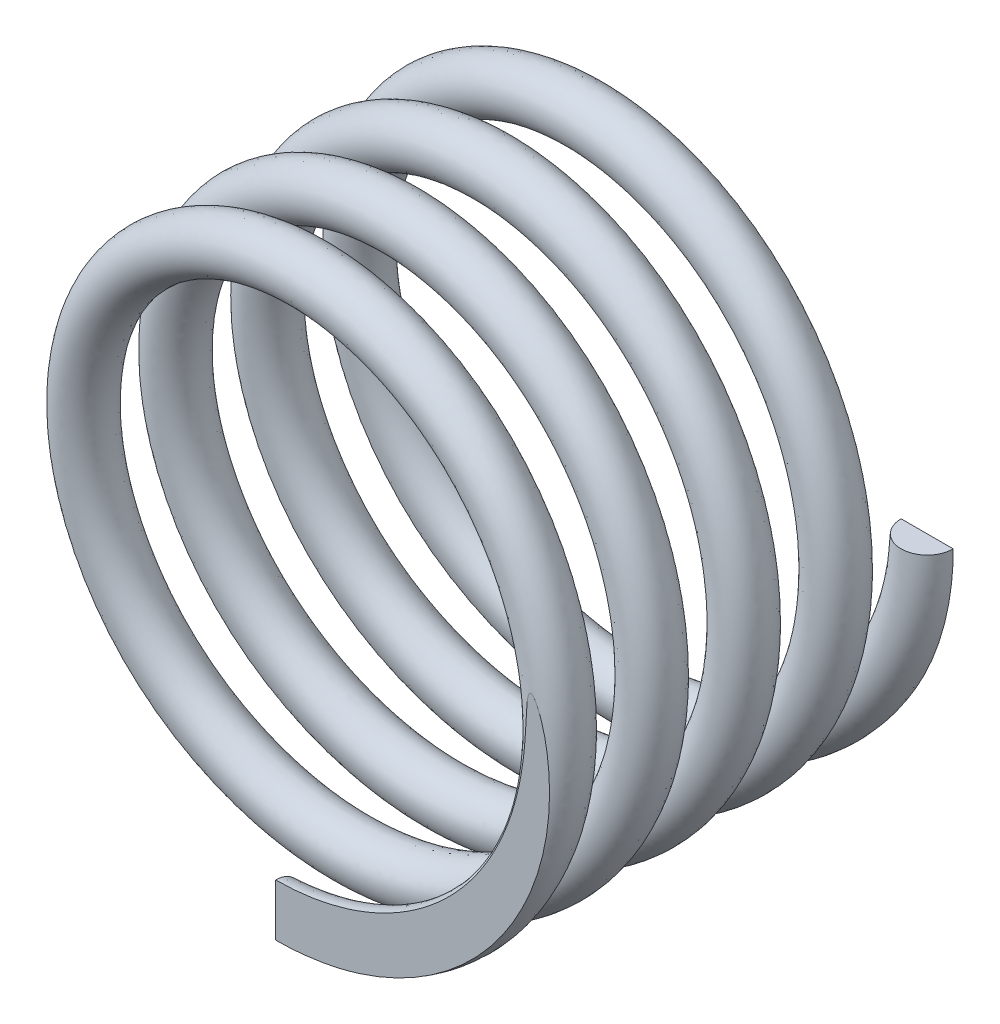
ISO-10303-21;
HEADER;
FILE_DESCRIPTION(('STEP AP214'),'2;1');
FILE_NAME('part.step','',(''),(''),'','','');
FILE_SCHEMA(('AUTOMOTIVE_DESIGN { 1 0 10303 214 1 1 1 1 }'));
ENDSEC;
DATA;
#1=APPLICATION_CONTEXT('core data for automotive mechanical design processes');
#2=APPLICATION_PROTOCOL_DEFINITION('international standard','automotive_design',2000,#1);
#3=PRODUCT_CONTEXT('',#1,'mechanical');
#4=PRODUCT('Part','Part','',(#3));
#5=PRODUCT_RELATED_PRODUCT_CATEGORY('part','',(#4));
#6=PRODUCT_DEFINITION_FORMATION('','',#4);
#7=PRODUCT_DEFINITION_CONTEXT('part definition',#1,'design');
#8=PRODUCT_DEFINITION('design','',#6,#7);
#9=PRODUCT_DEFINITION_SHAPE('','',#8);
#10=(LENGTH_UNIT() NAMED_UNIT(*) SI_UNIT(.MILLI.,.METRE.));
#11=(NAMED_UNIT(*) PLANE_ANGLE_UNIT() SI_UNIT($,.RADIAN.));
#12=(NAMED_UNIT(*) SI_UNIT($,.STERADIAN.) SOLID_ANGLE_UNIT());
#13=UNCERTAINTY_MEASURE_WITH_UNIT(LENGTH_MEASURE(1.E-05),#10,'distance_accuracy_value','');
#14=(GEOMETRIC_REPRESENTATION_CONTEXT(3) GLOBAL_UNCERTAINTY_ASSIGNED_CONTEXT((#13)) GLOBAL_UNIT_ASSIGNED_CONTEXT((#10,
#11,#12)) REPRESENTATION_CONTEXT('',''));
#15=CARTESIAN_POINT('',(0.,0.,0.));
#16=DIRECTION('',(0.,0.,1.));
#17=DIRECTION('',(1.,0.,0.));
#18=AXIS2_PLACEMENT_3D('',#15,#16,#17);
#19=CARTESIAN_POINT('',(5.,0.,-0.500000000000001));
#20=DIRECTION('',(0.,-1.,0.));
#21=DIRECTION('',(0.,0.,-1.));
#22=AXIS2_PLACEMENT_3D('',#19,#20,#21);
#23=PLANE('',#22);
#24=CARTESIAN_POINT('',(5.,0.,0.));
#25=DIRECTION('',(0.,1.,0.));
#26=DIRECTION('',(0.,0.,1.));
#27=AXIS2_PLACEMENT_3D('',#24,#25,#26);
#28=CIRCLE('',#27,0.500000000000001);
#29=CARTESIAN_POINT('',(4.5,0.,0.));
#30=VERTEX_POINT('',#29);
#31=CARTESIAN_POINT('',(5.5,0.,0.));
#32=VERTEX_POINT('',#31);
#33=EDGE_CURVE('E70',#30,#32,#28,.T.);
#34=ORIENTED_EDGE('',*,*,#33,.T.);
#35=DIRECTION('',(-1.,0.,0.));
#36=VECTOR('',#35,1.);
#37=CARTESIAN_POINT('',(5.,0.,0.));
#38=LINE('',#37,#36);
#39=EDGE_CURVE('E57',#32,#30,#38,.T.);
#40=ORIENTED_EDGE('',*,*,#39,.T.);
#41=EDGE_LOOP('',(#34,#40));
#42=FACE_BOUND('',#41,.T.);
#43=ADVANCED_FACE('F32',(#42),#23,.F.);
#44=CARTESIAN_POINT('',(-4.21831895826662E-13,-5.,7.00000000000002));
#45=DIRECTION('',(-1.,0.,0.));
#46=DIRECTION('',(0.,-1.,0.));
#47=AXIS2_PLACEMENT_3D('',#44,#45,#46);
#48=PLANE('',#47);
#49=DIRECTION('',(0.,-1.,0.));
#50=VECTOR('',#49,1.);
#51=CARTESIAN_POINT('',(-4.21831895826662E-13,-5.,7.5));
#52=LINE('',#51,#50);
#53=CARTESIAN_POINT('',(-3.79682048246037E-13,-4.5,7.5));
#54=VERTEX_POINT('',#53);
#55=CARTESIAN_POINT('',(-4.63981743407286E-13,-5.5,7.5));
#56=VERTEX_POINT('',#55);
#57=EDGE_CURVE('E51',#54,#56,#52,.T.);
#58=ORIENTED_EDGE('',*,*,#57,.F.);
#59=CARTESIAN_POINT('',(-4.21831895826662E-13,-5.,7.50000000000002));
#60=DIRECTION('',(-1.,0.,0.));
#61=DIRECTION('',(0.,-1.,0.));
#62=AXIS2_PLACEMENT_3D('',#59,#60,#61);
#63=CIRCLE('',#62,0.500000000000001);
#64=EDGE_CURVE('E67',#54,#56,#63,.T.);
#65=ORIENTED_EDGE('',*,*,#64,.T.);
#66=EDGE_LOOP('',(#58,#65));
#67=FACE_BOUND('',#66,.T.);
#68=ADVANCED_FACE('F34',(#67),#48,.T.);
#69=CARTESIAN_POINT('',(5.,0.,0.500000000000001));
#70=CARTESIAN_POINT('',(5.,-1.62459848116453,0.588235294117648));
#71=CARTESIAN_POINT('',(4.04508497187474,-2.93892626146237,0.676470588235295));
#72=CARTESIAN_POINT('',(3.09016994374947,-4.2532540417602,0.764705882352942));
#73=CARTESIAN_POINT('',(1.54508497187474,-4.75528258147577,0.852941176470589));
#74=CARTESIAN_POINT('',(0.,-5.25731112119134,0.941176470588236));
#75=CARTESIAN_POINT('',(-1.54508497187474,-4.75528258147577,1.02941176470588));
#76=CARTESIAN_POINT('',(-3.09016994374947,-4.2532540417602,1.11764705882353));
#77=CARTESIAN_POINT('',(-4.04508497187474,-2.93892626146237,1.20588235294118));
#78=CARTESIAN_POINT('',(-5.,-1.62459848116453,1.29411764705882));
#79=CARTESIAN_POINT('',(-5.,0.,1.38235294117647));
#80=CARTESIAN_POINT('',(-5.,1.62459848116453,1.47058823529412));
#81=CARTESIAN_POINT('',(-4.04508497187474,2.93892626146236,1.55882352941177));
#82=CARTESIAN_POINT('',(-3.09016994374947,4.2532540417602,1.64705882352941));
#83=CARTESIAN_POINT('',(-1.54508497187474,4.75528258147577,1.73529411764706));
#84=CARTESIAN_POINT('',(0.,5.25731112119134,1.82352941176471));
#85=CARTESIAN_POINT('',(1.54508497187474,4.75528258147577,1.91176470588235));
#86=CARTESIAN_POINT('',(3.09016994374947,4.2532540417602,2.));
#87=CARTESIAN_POINT('',(4.04508497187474,2.93892626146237,2.08823529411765));
#88=CARTESIAN_POINT('',(5.,1.62459848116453,2.17647058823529));
#89=CARTESIAN_POINT('',(5.,0.,2.26470588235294));
#90=CARTESIAN_POINT('',(5.,-1.62459848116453,2.35294117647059));
#91=CARTESIAN_POINT('',(4.04508497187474,-2.93892626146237,2.44117647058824));
#92=CARTESIAN_POINT('',(3.09016994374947,-4.2532540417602,2.52941176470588));
#93=CARTESIAN_POINT('',(1.54508497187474,-4.75528258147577,2.61764705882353));
#94=CARTESIAN_POINT('',(0.,-5.25731112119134,2.70588235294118));
#95=CARTESIAN_POINT('',(-1.54508497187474,-4.75528258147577,2.79411764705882));
#96=CARTESIAN_POINT('',(-3.09016994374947,-4.2532540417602,2.88235294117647));
#97=CARTESIAN_POINT('',(-4.04508497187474,-2.93892626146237,2.97058823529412));
#98=CARTESIAN_POINT('',(-5.,-1.62459848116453,3.05882352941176));
#99=CARTESIAN_POINT('',(-5.,0.,3.14705882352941));
#100=CARTESIAN_POINT('',(-5.,1.62459848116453,3.23529411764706));
#101=CARTESIAN_POINT('',(-4.04508497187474,2.93892626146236,3.32352941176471));
#102=CARTESIAN_POINT('',(-3.09016994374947,4.2532540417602,3.41176470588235));
#103=CARTESIAN_POINT('',(-1.54508497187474,4.75528258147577,3.5));
#104=CARTESIAN_POINT('',(0.,5.25731112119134,3.58823529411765));
#105=CARTESIAN_POINT('',(1.54508497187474,4.75528258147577,3.67647058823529));
#106=CARTESIAN_POINT('',(3.09016994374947,4.2532540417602,3.76470588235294));
#107=CARTESIAN_POINT('',(4.04508497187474,2.93892626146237,3.85294117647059));
#108=CARTESIAN_POINT('',(5.,1.62459848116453,3.94117647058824));
#109=CARTESIAN_POINT('',(5.,0.,4.02941176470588));
#110=CARTESIAN_POINT('',(5.,-1.62459848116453,4.11764705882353));
#111=CARTESIAN_POINT('',(4.04508497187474,-2.93892626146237,4.20588235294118));
#112=CARTESIAN_POINT('',(3.09016994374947,-4.2532540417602,4.29411764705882));
#113=CARTESIAN_POINT('',(1.54508497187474,-4.75528258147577,4.38235294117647));
#114=CARTESIAN_POINT('',(0.,-5.25731112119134,4.47058823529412));
#115=CARTESIAN_POINT('',(-1.54508497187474,-4.75528258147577,4.55882352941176));
#116=CARTESIAN_POINT('',(-3.09016994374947,-4.2532540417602,4.64705882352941));
#117=CARTESIAN_POINT('',(-4.04508497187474,-2.93892626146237,4.73529411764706));
#118=CARTESIAN_POINT('',(-5.,-1.62459848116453,4.82352941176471));
#119=CARTESIAN_POINT('',(-5.,0.,4.91176470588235));
#120=CARTESIAN_POINT('',(-5.,1.62459848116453,5.));
#121=CARTESIAN_POINT('',(-4.04508497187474,2.93892626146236,5.08823529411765));
#122=CARTESIAN_POINT('',(-3.09016994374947,4.2532540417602,5.17647058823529));
#123=CARTESIAN_POINT('',(-1.54508497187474,4.75528258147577,5.26470588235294));
#124=CARTESIAN_POINT('',(0.,5.25731112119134,5.35294117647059));
#125=CARTESIAN_POINT('',(1.54508497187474,4.75528258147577,5.44117647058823));
#126=CARTESIAN_POINT('',(3.09016994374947,4.2532540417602,5.52941176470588));
#127=CARTESIAN_POINT('',(4.04508497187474,2.93892626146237,5.61764705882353));
#128=CARTESIAN_POINT('',(5.,1.62459848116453,5.70588235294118));
#129=CARTESIAN_POINT('',(5.,0.,5.79411764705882));
#130=CARTESIAN_POINT('',(5.,-1.62459848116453,5.88235294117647));
#131=CARTESIAN_POINT('',(4.04508497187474,-2.93892626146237,5.97058823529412));
#132=CARTESIAN_POINT('',(3.09016994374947,-4.2532540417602,6.05882352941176));
#133=CARTESIAN_POINT('',(1.54508497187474,-4.75528258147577,6.14705882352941));
#134=CARTESIAN_POINT('',(0.,-5.25731112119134,6.23529411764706));
#135=CARTESIAN_POINT('',(-1.54508497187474,-4.75528258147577,6.32352941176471));
#136=CARTESIAN_POINT('',(-3.09016994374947,-4.2532540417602,6.41176470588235));
#137=CARTESIAN_POINT('',(-4.04508497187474,-2.93892626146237,6.5));
#138=CARTESIAN_POINT('',(-5.,-1.62459848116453,6.58823529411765));
#139=CARTESIAN_POINT('',(-5.,0.,6.67647058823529));
#140=CARTESIAN_POINT('',(-5.,1.62459848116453,6.76470588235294));
#141=CARTESIAN_POINT('',(-4.04508497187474,2.93892626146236,6.85294117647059));
#142=CARTESIAN_POINT('',(-3.09016994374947,4.2532540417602,6.94117647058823));
#143=CARTESIAN_POINT('',(-1.54508497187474,4.75528258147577,7.02941176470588));
#144=CARTESIAN_POINT('',(0.,5.25731112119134,7.11764705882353));
#145=CARTESIAN_POINT('',(1.54508497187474,4.75528258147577,7.20588235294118));
#146=CARTESIAN_POINT('',(3.09016994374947,4.2532540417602,7.29411764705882));
#147=CARTESIAN_POINT('',(4.04508497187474,2.93892626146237,7.38235294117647));
#148=CARTESIAN_POINT('',(5.,1.62459848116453,7.47058823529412));
#149=CARTESIAN_POINT('',(5.,0.,7.55882352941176));
#150=CARTESIAN_POINT('',(5.,-1.62459848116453,7.64705882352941));
#151=CARTESIAN_POINT('',(4.04508497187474,-2.93892626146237,7.73529411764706));
#152=CARTESIAN_POINT('',(3.09016994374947,-4.2532540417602,7.8235294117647));
#153=CARTESIAN_POINT('',(1.54508497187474,-4.75528258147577,7.91176470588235));
#154=CARTESIAN_POINT('',(0.791922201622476,-5.00000000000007,7.95477563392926));
#155=CARTESIAN_POINT('',(-4.21831895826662E-13,-5.,8.00000000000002));
#156=CARTESIAN_POINT('',(6.,0.,0.500000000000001));
#157=CARTESIAN_POINT('',(6.,-1.94951817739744,0.588235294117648));
#158=CARTESIAN_POINT('',(4.85410196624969,-3.52671151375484,0.676470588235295));
#159=CARTESIAN_POINT('',(3.70820393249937,-5.10390485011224,0.764705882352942));
#160=CARTESIAN_POINT('',(1.85410196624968,-5.70633909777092,0.852941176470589));
#161=CARTESIAN_POINT('',(0.,-6.3087733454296,0.941176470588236));
#162=CARTESIAN_POINT('',(-1.85410196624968,-5.70633909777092,1.02941176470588));
#163=CARTESIAN_POINT('',(-3.70820393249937,-5.10390485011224,1.11764705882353));
#164=CARTESIAN_POINT('',(-4.85410196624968,-3.52671151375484,1.20588235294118));
#165=CARTESIAN_POINT('',(-6.,-1.94951817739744,1.29411764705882));
#166=CARTESIAN_POINT('',(-6.,0.,1.38235294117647));
#167=CARTESIAN_POINT('',(-6.,1.94951817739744,1.47058823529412));
#168=CARTESIAN_POINT('',(-4.85410196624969,3.52671151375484,1.55882352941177));
#169=CARTESIAN_POINT('',(-3.70820393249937,5.10390485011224,1.64705882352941));
#170=CARTESIAN_POINT('',(-1.85410196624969,5.70633909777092,1.73529411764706));
#171=CARTESIAN_POINT('',(0.,6.3087733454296,1.82352941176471));
#172=CARTESIAN_POINT('',(1.85410196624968,5.70633909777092,1.91176470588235));
#173=CARTESIAN_POINT('',(3.70820393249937,5.10390485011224,2.));
#174=CARTESIAN_POINT('',(4.85410196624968,3.52671151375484,2.08823529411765));
#175=CARTESIAN_POINT('',(6.,1.94951817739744,2.17647058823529));
#176=CARTESIAN_POINT('',(6.,0.,2.26470588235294));
#177=CARTESIAN_POINT('',(6.,-1.94951817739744,2.35294117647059));
#178=CARTESIAN_POINT('',(4.85410196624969,-3.52671151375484,2.44117647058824));
#179=CARTESIAN_POINT('',(3.70820393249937,-5.10390485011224,2.52941176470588));
#180=CARTESIAN_POINT('',(1.85410196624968,-5.70633909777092,2.61764705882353));
#181=CARTESIAN_POINT('',(0.,-6.3087733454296,2.70588235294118));
#182=CARTESIAN_POINT('',(-1.85410196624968,-5.70633909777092,2.79411764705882));
#183=CARTESIAN_POINT('',(-3.70820393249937,-5.10390485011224,2.88235294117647));
#184=CARTESIAN_POINT('',(-4.85410196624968,-3.52671151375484,2.97058823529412));
#185=CARTESIAN_POINT('',(-6.,-1.94951817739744,3.05882352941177));
#186=CARTESIAN_POINT('',(-6.,0.,3.14705882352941));
#187=CARTESIAN_POINT('',(-6.,1.94951817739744,3.23529411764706));
#188=CARTESIAN_POINT('',(-4.85410196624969,3.52671151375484,3.32352941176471));
#189=CARTESIAN_POINT('',(-3.70820393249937,5.10390485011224,3.41176470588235));
#190=CARTESIAN_POINT('',(-1.85410196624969,5.70633909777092,3.5));
#191=CARTESIAN_POINT('',(0.,6.3087733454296,3.58823529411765));
#192=CARTESIAN_POINT('',(1.85410196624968,5.70633909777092,3.67647058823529));
#193=CARTESIAN_POINT('',(3.70820393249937,5.10390485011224,3.76470588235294));
#194=CARTESIAN_POINT('',(4.85410196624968,3.52671151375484,3.85294117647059));
#195=CARTESIAN_POINT('',(6.,1.94951817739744,3.94117647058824));
#196=CARTESIAN_POINT('',(6.,0.,4.02941176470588));
#197=CARTESIAN_POINT('',(6.,-1.94951817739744,4.11764705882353));
#198=CARTESIAN_POINT('',(4.85410196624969,-3.52671151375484,4.20588235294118));
#199=CARTESIAN_POINT('',(3.70820393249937,-5.10390485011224,4.29411764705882));
#200=CARTESIAN_POINT('',(1.85410196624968,-5.70633909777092,4.38235294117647));
#201=CARTESIAN_POINT('',(0.,-6.3087733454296,4.47058823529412));
#202=CARTESIAN_POINT('',(-1.85410196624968,-5.70633909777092,4.55882352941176));
#203=CARTESIAN_POINT('',(-3.70820393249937,-5.10390485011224,4.64705882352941));
#204=CARTESIAN_POINT('',(-4.85410196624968,-3.52671151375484,4.73529411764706));
#205=CARTESIAN_POINT('',(-6.,-1.94951817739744,4.8235294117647));
#206=CARTESIAN_POINT('',(-6.,0.,4.91176470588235));
#207=CARTESIAN_POINT('',(-6.,1.94951817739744,5.));
#208=CARTESIAN_POINT('',(-4.85410196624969,3.52671151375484,5.08823529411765));
#209=CARTESIAN_POINT('',(-3.70820393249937,5.10390485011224,5.17647058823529));
#210=CARTESIAN_POINT('',(-1.85410196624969,5.70633909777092,5.26470588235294));
#211=CARTESIAN_POINT('',(0.,6.3087733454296,5.35294117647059));
#212=CARTESIAN_POINT('',(1.85410196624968,5.70633909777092,5.44117647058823));
#213=CARTESIAN_POINT('',(3.70820393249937,5.10390485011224,5.52941176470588));
#214=CARTESIAN_POINT('',(4.85410196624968,3.52671151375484,5.61764705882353));
#215=CARTESIAN_POINT('',(6.,1.94951817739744,5.70588235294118));
#216=CARTESIAN_POINT('',(6.,0.,5.79411764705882));
#217=CARTESIAN_POINT('',(6.,-1.94951817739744,5.88235294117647));
#218=CARTESIAN_POINT('',(4.85410196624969,-3.52671151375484,5.97058823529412));
#219=CARTESIAN_POINT('',(3.70820393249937,-5.10390485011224,6.05882352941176));
#220=CARTESIAN_POINT('',(1.85410196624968,-5.70633909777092,6.14705882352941));
#221=CARTESIAN_POINT('',(0.,-6.3087733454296,6.23529411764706));
#222=CARTESIAN_POINT('',(-1.85410196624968,-5.70633909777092,6.32352941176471));
#223=CARTESIAN_POINT('',(-3.70820393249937,-5.10390485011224,6.41176470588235));
#224=CARTESIAN_POINT('',(-4.85410196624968,-3.52671151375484,6.5));
#225=CARTESIAN_POINT('',(-6.,-1.94951817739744,6.58823529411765));
#226=CARTESIAN_POINT('',(-6.,0.,6.67647058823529));
#227=CARTESIAN_POINT('',(-6.,1.94951817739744,6.76470588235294));
#228=CARTESIAN_POINT('',(-4.85410196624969,3.52671151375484,6.85294117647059));
#229=CARTESIAN_POINT('',(-3.70820393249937,5.10390485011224,6.94117647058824));
#230=CARTESIAN_POINT('',(-1.85410196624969,5.70633909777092,7.02941176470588));
#231=CARTESIAN_POINT('',(0.,6.3087733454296,7.11764705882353));
#232=CARTESIAN_POINT('',(1.85410196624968,5.70633909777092,7.20588235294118));
#233=CARTESIAN_POINT('',(3.70820393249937,5.10390485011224,7.29411764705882));
#234=CARTESIAN_POINT('',(4.85410196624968,3.52671151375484,7.38235294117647));
#235=CARTESIAN_POINT('',(6.,1.94951817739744,7.47058823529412));
#236=CARTESIAN_POINT('',(6.,0.,7.55882352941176));
#237=CARTESIAN_POINT('',(6.,-1.94951817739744,7.64705882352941));
#238=CARTESIAN_POINT('',(4.85410196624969,-3.52671151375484,7.73529411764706));
#239=CARTESIAN_POINT('',(3.70820393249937,-5.10390485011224,7.8235294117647));
#240=CARTESIAN_POINT('',(1.85410196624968,-5.70633909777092,7.91176470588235));
#241=CARTESIAN_POINT('',(0.950306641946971,-6.00000000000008,7.95477563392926));
#242=CARTESIAN_POINT('',(-5.06131590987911E-13,-6.,8.00000000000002));
#243=CARTESIAN_POINT('',(6.,0.,-0.500000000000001));
#244=CARTESIAN_POINT('',(6.,-1.94951817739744,-0.411764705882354));
#245=CARTESIAN_POINT('',(4.85410196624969,-3.52671151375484,-0.323529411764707));
#246=CARTESIAN_POINT('',(3.70820393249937,-5.10390485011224,-0.23529411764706));
#247=CARTESIAN_POINT('',(1.85410196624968,-5.70633909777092,-0.147058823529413));
#248=CARTESIAN_POINT('',(0.,-6.3087733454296,-0.0588235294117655));
#249=CARTESIAN_POINT('',(-1.85410196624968,-5.70633909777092,0.0294117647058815));
#250=CARTESIAN_POINT('',(-3.70820393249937,-5.10390485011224,0.117647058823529));
#251=CARTESIAN_POINT('',(-4.85410196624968,-3.52671151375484,0.205882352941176));
#252=CARTESIAN_POINT('',(-6.,-1.94951817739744,0.294117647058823));
#253=CARTESIAN_POINT('',(-6.,0.,0.38235294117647));
#254=CARTESIAN_POINT('',(-6.,1.94951817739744,0.470588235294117));
#255=CARTESIAN_POINT('',(-4.85410196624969,3.52671151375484,0.558823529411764));
#256=CARTESIAN_POINT('',(-3.70820393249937,5.10390485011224,0.647058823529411));
#257=CARTESIAN_POINT('',(-1.85410196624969,5.70633909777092,0.735294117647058));
#258=CARTESIAN_POINT('',(0.,6.3087733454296,0.823529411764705));
#259=CARTESIAN_POINT('',(1.85410196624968,5.70633909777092,0.911764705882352));
#260=CARTESIAN_POINT('',(3.70820393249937,5.10390485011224,0.999999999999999));
#261=CARTESIAN_POINT('',(4.85410196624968,3.52671151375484,1.08823529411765));
#262=CARTESIAN_POINT('',(6.,1.94951817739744,1.17647058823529));
#263=CARTESIAN_POINT('',(6.,0.,1.26470588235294));
#264=CARTESIAN_POINT('',(6.,-1.94951817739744,1.35294117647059));
#265=CARTESIAN_POINT('',(4.85410196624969,-3.52671151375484,1.44117647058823));
#266=CARTESIAN_POINT('',(3.70820393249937,-5.10390485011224,1.52941176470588));
#267=CARTESIAN_POINT('',(1.85410196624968,-5.70633909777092,1.61764705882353));
#268=CARTESIAN_POINT('',(0.,-6.3087733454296,1.70588235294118));
#269=CARTESIAN_POINT('',(-1.85410196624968,-5.70633909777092,1.79411764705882));
#270=CARTESIAN_POINT('',(-3.70820393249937,-5.10390485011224,1.88235294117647));
#271=CARTESIAN_POINT('',(-4.85410196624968,-3.52671151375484,1.97058823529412));
#272=CARTESIAN_POINT('',(-6.,-1.94951817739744,2.05882352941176));
#273=CARTESIAN_POINT('',(-6.,0.,2.14705882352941));
#274=CARTESIAN_POINT('',(-6.,1.94951817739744,2.23529411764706));
#275=CARTESIAN_POINT('',(-4.85410196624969,3.52671151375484,2.3235294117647));
#276=CARTESIAN_POINT('',(-3.70820393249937,5.10390485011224,2.41176470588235));
#277=CARTESIAN_POINT('',(-1.85410196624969,5.70633909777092,2.5));
#278=CARTESIAN_POINT('',(0.,6.3087733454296,2.58823529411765));
#279=CARTESIAN_POINT('',(1.85410196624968,5.70633909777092,2.67647058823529));
#280=CARTESIAN_POINT('',(3.70820393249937,5.10390485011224,2.76470588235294));
#281=CARTESIAN_POINT('',(4.85410196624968,3.52671151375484,2.85294117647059));
#282=CARTESIAN_POINT('',(6.,1.94951817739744,2.94117647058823));
#283=CARTESIAN_POINT('',(6.,0.,3.02941176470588));
#284=CARTESIAN_POINT('',(6.,-1.94951817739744,3.11764705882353));
#285=CARTESIAN_POINT('',(4.85410196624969,-3.52671151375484,3.20588235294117));
#286=CARTESIAN_POINT('',(3.70820393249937,-5.10390485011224,3.29411764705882));
#287=CARTESIAN_POINT('',(1.85410196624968,-5.70633909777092,3.38235294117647));
#288=CARTESIAN_POINT('',(0.,-6.3087733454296,3.47058823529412));
#289=CARTESIAN_POINT('',(-1.85410196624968,-5.70633909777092,3.55882352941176));
#290=CARTESIAN_POINT('',(-3.70820393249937,-5.10390485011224,3.64705882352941));
#291=CARTESIAN_POINT('',(-4.85410196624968,-3.52671151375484,3.73529411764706));
#292=CARTESIAN_POINT('',(-6.,-1.94951817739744,3.82352941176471));
#293=CARTESIAN_POINT('',(-6.,0.,3.91176470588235));
#294=CARTESIAN_POINT('',(-6.,1.94951817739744,4.));
#295=CARTESIAN_POINT('',(-4.85410196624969,3.52671151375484,4.08823529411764));
#296=CARTESIAN_POINT('',(-3.70820393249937,5.10390485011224,4.17647058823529));
#297=CARTESIAN_POINT('',(-1.85410196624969,5.70633909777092,4.26470588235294));
#298=CARTESIAN_POINT('',(0.,6.3087733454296,4.35294117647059));
#299=CARTESIAN_POINT('',(1.85410196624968,5.70633909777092,4.44117647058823));
#300=CARTESIAN_POINT('',(3.70820393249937,5.10390485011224,4.52941176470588));
#301=CARTESIAN_POINT('',(4.85410196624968,3.52671151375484,4.61764705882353));
#302=CARTESIAN_POINT('',(6.,1.94951817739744,4.70588235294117));
#303=CARTESIAN_POINT('',(6.,0.,4.79411764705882));
#304=CARTESIAN_POINT('',(6.,-1.94951817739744,4.88235294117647));
#305=CARTESIAN_POINT('',(4.85410196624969,-3.52671151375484,4.97058823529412));
#306=CARTESIAN_POINT('',(3.70820393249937,-5.10390485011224,5.05882352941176));
#307=CARTESIAN_POINT('',(1.85410196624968,-5.70633909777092,5.14705882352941));
#308=CARTESIAN_POINT('',(0.,-6.3087733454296,5.23529411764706));
#309=CARTESIAN_POINT('',(-1.85410196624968,-5.70633909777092,5.3235294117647));
#310=CARTESIAN_POINT('',(-3.70820393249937,-5.10390485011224,5.41176470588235));
#311=CARTESIAN_POINT('',(-4.85410196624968,-3.52671151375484,5.5));
#312=CARTESIAN_POINT('',(-6.,-1.94951817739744,5.58823529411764));
#313=CARTESIAN_POINT('',(-6.,0.,5.67647058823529));
#314=CARTESIAN_POINT('',(-6.,1.94951817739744,5.76470588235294));
#315=CARTESIAN_POINT('',(-4.85410196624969,3.52671151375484,5.85294117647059));
#316=CARTESIAN_POINT('',(-3.70820393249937,5.10390485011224,5.94117647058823));
#317=CARTESIAN_POINT('',(-1.85410196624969,5.70633909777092,6.02941176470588));
#318=CARTESIAN_POINT('',(0.,6.3087733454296,6.11764705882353));
#319=CARTESIAN_POINT('',(1.85410196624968,5.70633909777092,6.20588235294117));
#320=CARTESIAN_POINT('',(3.70820393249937,5.10390485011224,6.29411764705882));
#321=CARTESIAN_POINT('',(4.85410196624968,3.52671151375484,6.38235294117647));
#322=CARTESIAN_POINT('',(6.,1.94951817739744,6.47058823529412));
#323=CARTESIAN_POINT('',(6.,0.,6.55882352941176));
#324=CARTESIAN_POINT('',(6.,-1.94951817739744,6.64705882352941));
#325=CARTESIAN_POINT('',(4.85410196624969,-3.52671151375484,6.73529411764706));
#326=CARTESIAN_POINT('',(3.70820393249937,-5.10390485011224,6.8235294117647));
#327=CARTESIAN_POINT('',(1.85410196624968,-5.70633909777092,6.91176470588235));
#328=CARTESIAN_POINT('',(0.950306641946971,-6.00000000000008,6.95477563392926));
#329=CARTESIAN_POINT('',(-5.06131590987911E-13,-6.,7.00000000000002));
#330=CARTESIAN_POINT('',(5.,0.,-0.500000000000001));
#331=CARTESIAN_POINT('',(5.,-1.62459848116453,-0.411764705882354));
#332=CARTESIAN_POINT('',(4.04508497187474,-2.93892626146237,-0.323529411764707));
#333=CARTESIAN_POINT('',(3.09016994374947,-4.2532540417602,-0.23529411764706));
#334=CARTESIAN_POINT('',(1.54508497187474,-4.75528258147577,-0.147058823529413));
#335=CARTESIAN_POINT('',(0.,-5.25731112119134,-0.0588235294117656));
#336=CARTESIAN_POINT('',(-1.54508497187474,-4.75528258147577,0.0294117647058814));
#337=CARTESIAN_POINT('',(-3.09016994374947,-4.2532540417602,0.117647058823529));
#338=CARTESIAN_POINT('',(-4.04508497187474,-2.93892626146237,0.205882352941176));
#339=CARTESIAN_POINT('',(-5.,-1.62459848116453,0.294117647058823));
#340=CARTESIAN_POINT('',(-5.,0.,0.38235294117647));
#341=CARTESIAN_POINT('',(-5.,1.62459848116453,0.470588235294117));
#342=CARTESIAN_POINT('',(-4.04508497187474,2.93892626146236,0.558823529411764));
#343=CARTESIAN_POINT('',(-3.09016994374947,4.2532540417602,0.647058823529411));
#344=CARTESIAN_POINT('',(-1.54508497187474,4.75528258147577,0.735294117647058));
#345=CARTESIAN_POINT('',(0.,5.25731112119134,0.823529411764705));
#346=CARTESIAN_POINT('',(1.54508497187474,4.75528258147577,0.911764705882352));
#347=CARTESIAN_POINT('',(3.09016994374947,4.2532540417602,0.999999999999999));
#348=CARTESIAN_POINT('',(4.04508497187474,2.93892626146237,1.08823529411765));
#349=CARTESIAN_POINT('',(5.,1.62459848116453,1.17647058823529));
#350=CARTESIAN_POINT('',(5.,0.,1.26470588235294));
#351=CARTESIAN_POINT('',(5.,-1.62459848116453,1.35294117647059));
#352=CARTESIAN_POINT('',(4.04508497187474,-2.93892626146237,1.44117647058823));
#353=CARTESIAN_POINT('',(3.09016994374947,-4.2532540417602,1.52941176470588));
#354=CARTESIAN_POINT('',(1.54508497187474,-4.75528258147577,1.61764705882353));
#355=CARTESIAN_POINT('',(0.,-5.25731112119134,1.70588235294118));
#356=CARTESIAN_POINT('',(-1.54508497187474,-4.75528258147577,1.79411764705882));
#357=CARTESIAN_POINT('',(-3.09016994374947,-4.2532540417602,1.88235294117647));
#358=CARTESIAN_POINT('',(-4.04508497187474,-2.93892626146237,1.97058823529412));
#359=CARTESIAN_POINT('',(-5.,-1.62459848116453,2.05882352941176));
#360=CARTESIAN_POINT('',(-5.,0.,2.14705882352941));
#361=CARTESIAN_POINT('',(-5.,1.62459848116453,2.23529411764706));
#362=CARTESIAN_POINT('',(-4.04508497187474,2.93892626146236,2.3235294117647));
#363=CARTESIAN_POINT('',(-3.09016994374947,4.2532540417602,2.41176470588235));
#364=CARTESIAN_POINT('',(-1.54508497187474,4.75528258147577,2.5));
#365=CARTESIAN_POINT('',(0.,5.25731112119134,2.58823529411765));
#366=CARTESIAN_POINT('',(1.54508497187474,4.75528258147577,2.67647058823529));
#367=CARTESIAN_POINT('',(3.09016994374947,4.2532540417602,2.76470588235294));
#368=CARTESIAN_POINT('',(4.04508497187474,2.93892626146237,2.85294117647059));
#369=CARTESIAN_POINT('',(5.,1.62459848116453,2.94117647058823));
#370=CARTESIAN_POINT('',(5.,0.,3.02941176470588));
#371=CARTESIAN_POINT('',(5.,-1.62459848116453,3.11764705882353));
#372=CARTESIAN_POINT('',(4.04508497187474,-2.93892626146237,3.20588235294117));
#373=CARTESIAN_POINT('',(3.09016994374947,-4.2532540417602,3.29411764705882));
#374=CARTESIAN_POINT('',(1.54508497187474,-4.75528258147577,3.38235294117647));
#375=CARTESIAN_POINT('',(0.,-5.25731112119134,3.47058823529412));
#376=CARTESIAN_POINT('',(-1.54508497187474,-4.75528258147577,3.55882352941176));
#377=CARTESIAN_POINT('',(-3.09016994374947,-4.2532540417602,3.64705882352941));
#378=CARTESIAN_POINT('',(-4.04508497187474,-2.93892626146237,3.73529411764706));
#379=CARTESIAN_POINT('',(-5.,-1.62459848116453,3.8235294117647));
#380=CARTESIAN_POINT('',(-5.,0.,3.91176470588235));
#381=CARTESIAN_POINT('',(-5.,1.62459848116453,4.));
#382=CARTESIAN_POINT('',(-4.04508497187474,2.93892626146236,4.08823529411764));
#383=CARTESIAN_POINT('',(-3.09016994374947,4.2532540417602,4.17647058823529));
#384=CARTESIAN_POINT('',(-1.54508497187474,4.75528258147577,4.26470588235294));
#385=CARTESIAN_POINT('',(0.,5.25731112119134,4.35294117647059));
#386=CARTESIAN_POINT('',(1.54508497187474,4.75528258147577,4.44117647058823));
#387=CARTESIAN_POINT('',(3.09016994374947,4.2532540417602,4.52941176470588));
#388=CARTESIAN_POINT('',(4.04508497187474,2.93892626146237,4.61764705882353));
#389=CARTESIAN_POINT('',(5.,1.62459848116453,4.70588235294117));
#390=CARTESIAN_POINT('',(5.,0.,4.79411764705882));
#391=CARTESIAN_POINT('',(5.,-1.62459848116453,4.88235294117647));
#392=CARTESIAN_POINT('',(4.04508497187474,-2.93892626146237,4.97058823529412));
#393=CARTESIAN_POINT('',(3.09016994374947,-4.2532540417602,5.05882352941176));
#394=CARTESIAN_POINT('',(1.54508497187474,-4.75528258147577,5.14705882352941));
#395=CARTESIAN_POINT('',(0.,-5.25731112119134,5.23529411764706));
#396=CARTESIAN_POINT('',(-1.54508497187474,-4.75528258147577,5.3235294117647));
#397=CARTESIAN_POINT('',(-3.09016994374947,-4.2532540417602,5.41176470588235));
#398=CARTESIAN_POINT('',(-4.04508497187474,-2.93892626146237,5.5));
#399=CARTESIAN_POINT('',(-5.,-1.62459848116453,5.58823529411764));
#400=CARTESIAN_POINT('',(-5.,0.,5.67647058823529));
#401=CARTESIAN_POINT('',(-5.,1.62459848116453,5.76470588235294));
#402=CARTESIAN_POINT('',(-4.04508497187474,2.93892626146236,5.85294117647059));
#403=CARTESIAN_POINT('',(-3.09016994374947,4.2532540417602,5.94117647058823));
#404=CARTESIAN_POINT('',(-1.54508497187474,4.75528258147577,6.02941176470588));
#405=CARTESIAN_POINT('',(0.,5.25731112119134,6.11764705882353));
#406=CARTESIAN_POINT('',(1.54508497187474,4.75528258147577,6.20588235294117));
#407=CARTESIAN_POINT('',(3.09016994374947,4.2532540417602,6.29411764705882));
#408=CARTESIAN_POINT('',(4.04508497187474,2.93892626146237,6.38235294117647));
#409=CARTESIAN_POINT('',(5.,1.62459848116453,6.47058823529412));
#410=CARTESIAN_POINT('',(5.,0.,6.55882352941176));
#411=CARTESIAN_POINT('',(5.,-1.62459848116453,6.64705882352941));
#412=CARTESIAN_POINT('',(4.04508497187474,-2.93892626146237,6.73529411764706));
#413=CARTESIAN_POINT('',(3.09016994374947,-4.2532540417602,6.8235294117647));
#414=CARTESIAN_POINT('',(1.54508497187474,-4.75528258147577,6.91176470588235));
#415=CARTESIAN_POINT('',(0.791922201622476,-5.00000000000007,6.95477563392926));
#416=CARTESIAN_POINT('',(-4.21831895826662E-13,-5.,7.00000000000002));
#417=CARTESIAN_POINT('',(4.,0.,-0.500000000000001));
#418=CARTESIAN_POINT('',(4.,-1.29967878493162,-0.411764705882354));
#419=CARTESIAN_POINT('',(3.23606797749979,-2.35114100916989,-0.323529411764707));
#420=CARTESIAN_POINT('',(2.47213595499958,-3.40260323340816,-0.23529411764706));
#421=CARTESIAN_POINT('',(1.23606797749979,-3.80422606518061,-0.147058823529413));
#422=CARTESIAN_POINT('',(0.,-4.20584889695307,-0.0588235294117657));
#423=CARTESIAN_POINT('',(-1.23606797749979,-3.80422606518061,0.0294117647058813));
#424=CARTESIAN_POINT('',(-2.47213595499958,-3.40260323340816,0.117647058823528));
#425=CARTESIAN_POINT('',(-3.23606797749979,-2.35114100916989,0.205882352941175));
#426=CARTESIAN_POINT('',(-4.,-1.29967878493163,0.294117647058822));
#427=CARTESIAN_POINT('',(-4.,0.,0.38235294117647));
#428=CARTESIAN_POINT('',(-4.,1.29967878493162,0.470588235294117));
#429=CARTESIAN_POINT('',(-3.23606797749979,2.35114100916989,0.558823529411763));
#430=CARTESIAN_POINT('',(-2.47213595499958,3.40260323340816,0.647058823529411));
#431=CARTESIAN_POINT('',(-1.23606797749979,3.80422606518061,0.735294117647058));
#432=CARTESIAN_POINT('',(0.,4.20584889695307,0.823529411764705));
#433=CARTESIAN_POINT('',(1.23606797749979,3.80422606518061,0.911764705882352));
#434=CARTESIAN_POINT('',(2.47213595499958,3.40260323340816,0.999999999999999));
#435=CARTESIAN_POINT('',(3.23606797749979,2.35114100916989,1.08823529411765));
#436=CARTESIAN_POINT('',(4.,1.29967878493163,1.17647058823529));
#437=CARTESIAN_POINT('',(4.,0.,1.26470588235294));
#438=CARTESIAN_POINT('',(4.,-1.29967878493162,1.35294117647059));
#439=CARTESIAN_POINT('',(3.23606797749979,-2.35114100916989,1.44117647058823));
#440=CARTESIAN_POINT('',(2.47213595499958,-3.40260323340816,1.52941176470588));
#441=CARTESIAN_POINT('',(1.23606797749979,-3.80422606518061,1.61764705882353));
#442=CARTESIAN_POINT('',(0.,-4.20584889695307,1.70588235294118));
#443=CARTESIAN_POINT('',(-1.23606797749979,-3.80422606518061,1.79411764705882));
#444=CARTESIAN_POINT('',(-2.47213595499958,-3.40260323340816,1.88235294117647));
#445=CARTESIAN_POINT('',(-3.23606797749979,-2.35114100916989,1.97058823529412));
#446=CARTESIAN_POINT('',(-4.,-1.29967878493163,2.05882352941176));
#447=CARTESIAN_POINT('',(-4.,0.,2.14705882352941));
#448=CARTESIAN_POINT('',(-4.,1.29967878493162,2.23529411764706));
#449=CARTESIAN_POINT('',(-3.23606797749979,2.35114100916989,2.3235294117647));
#450=CARTESIAN_POINT('',(-2.47213595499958,3.40260323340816,2.41176470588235));
#451=CARTESIAN_POINT('',(-1.23606797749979,3.80422606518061,2.5));
#452=CARTESIAN_POINT('',(0.,4.20584889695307,2.58823529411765));
#453=CARTESIAN_POINT('',(1.23606797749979,3.80422606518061,2.67647058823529));
#454=CARTESIAN_POINT('',(2.47213595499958,3.40260323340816,2.76470588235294));
#455=CARTESIAN_POINT('',(3.23606797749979,2.35114100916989,2.85294117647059));
#456=CARTESIAN_POINT('',(4.,1.29967878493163,2.94117647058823));
#457=CARTESIAN_POINT('',(4.,0.,3.02941176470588));
#458=CARTESIAN_POINT('',(4.,-1.29967878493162,3.11764705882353));
#459=CARTESIAN_POINT('',(3.23606797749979,-2.35114100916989,3.20588235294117));
#460=CARTESIAN_POINT('',(2.47213595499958,-3.40260323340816,3.29411764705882));
#461=CARTESIAN_POINT('',(1.23606797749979,-3.80422606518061,3.38235294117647));
#462=CARTESIAN_POINT('',(0.,-4.20584889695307,3.47058823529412));
#463=CARTESIAN_POINT('',(-1.23606797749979,-3.80422606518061,3.55882352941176));
#464=CARTESIAN_POINT('',(-2.47213595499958,-3.40260323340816,3.64705882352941));
#465=CARTESIAN_POINT('',(-3.23606797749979,-2.35114100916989,3.73529411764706));
#466=CARTESIAN_POINT('',(-4.,-1.29967878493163,3.8235294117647));
#467=CARTESIAN_POINT('',(-4.,0.,3.91176470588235));
#468=CARTESIAN_POINT('',(-4.,1.29967878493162,4.));
#469=CARTESIAN_POINT('',(-3.23606797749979,2.35114100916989,4.08823529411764));
#470=CARTESIAN_POINT('',(-2.47213595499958,3.40260323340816,4.17647058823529));
#471=CARTESIAN_POINT('',(-1.23606797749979,3.80422606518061,4.26470588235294));
#472=CARTESIAN_POINT('',(0.,4.20584889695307,4.35294117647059));
#473=CARTESIAN_POINT('',(1.23606797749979,3.80422606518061,4.44117647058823));
#474=CARTESIAN_POINT('',(2.47213595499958,3.40260323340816,4.52941176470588));
#475=CARTESIAN_POINT('',(3.23606797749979,2.35114100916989,4.61764705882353));
#476=CARTESIAN_POINT('',(4.,1.29967878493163,4.70588235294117));
#477=CARTESIAN_POINT('',(4.,0.,4.79411764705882));
#478=CARTESIAN_POINT('',(4.,-1.29967878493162,4.88235294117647));
#479=CARTESIAN_POINT('',(3.23606797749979,-2.35114100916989,4.97058823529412));
#480=CARTESIAN_POINT('',(2.47213595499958,-3.40260323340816,5.05882352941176));
#481=CARTESIAN_POINT('',(1.23606797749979,-3.80422606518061,5.14705882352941));
#482=CARTESIAN_POINT('',(0.,-4.20584889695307,5.23529411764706));
#483=CARTESIAN_POINT('',(-1.23606797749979,-3.80422606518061,5.3235294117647));
#484=CARTESIAN_POINT('',(-2.47213595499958,-3.40260323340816,5.41176470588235));
#485=CARTESIAN_POINT('',(-3.23606797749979,-2.35114100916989,5.5));
#486=CARTESIAN_POINT('',(-4.,-1.29967878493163,5.58823529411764));
#487=CARTESIAN_POINT('',(-4.,0.,5.67647058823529));
#488=CARTESIAN_POINT('',(-4.,1.29967878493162,5.76470588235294));
#489=CARTESIAN_POINT('',(-3.23606797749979,2.35114100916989,5.85294117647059));
#490=CARTESIAN_POINT('',(-2.47213595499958,3.40260323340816,5.94117647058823));
#491=CARTESIAN_POINT('',(-1.23606797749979,3.80422606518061,6.02941176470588));
#492=CARTESIAN_POINT('',(0.,4.20584889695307,6.11764705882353));
#493=CARTESIAN_POINT('',(1.23606797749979,3.80422606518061,6.20588235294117));
#494=CARTESIAN_POINT('',(2.47213595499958,3.40260323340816,6.29411764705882));
#495=CARTESIAN_POINT('',(3.23606797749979,2.35114100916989,6.38235294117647));
#496=CARTESIAN_POINT('',(4.,1.29967878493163,6.47058823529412));
#497=CARTESIAN_POINT('',(4.,0.,6.55882352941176));
#498=CARTESIAN_POINT('',(4.,-1.29967878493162,6.64705882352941));
#499=CARTESIAN_POINT('',(3.23606797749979,-2.35114100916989,6.73529411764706));
#500=CARTESIAN_POINT('',(2.47213595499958,-3.40260323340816,6.8235294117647));
#501=CARTESIAN_POINT('',(1.23606797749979,-3.80422606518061,6.91176470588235));
#502=CARTESIAN_POINT('',(0.633537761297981,-4.00000000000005,6.95477563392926));
#503=CARTESIAN_POINT('',(-3.37296028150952E-13,-4.,7.00000000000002));
#504=CARTESIAN_POINT('',(4.,0.,0.500000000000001));
#505=CARTESIAN_POINT('',(4.,-1.29967878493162,0.588235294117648));
#506=CARTESIAN_POINT('',(3.23606797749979,-2.35114100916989,0.676470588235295));
#507=CARTESIAN_POINT('',(2.47213595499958,-3.40260323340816,0.764705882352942));
#508=CARTESIAN_POINT('',(1.23606797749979,-3.80422606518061,0.852941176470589));
#509=CARTESIAN_POINT('',(0.,-4.20584889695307,0.941176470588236));
#510=CARTESIAN_POINT('',(-1.23606797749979,-3.80422606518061,1.02941176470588));
#511=CARTESIAN_POINT('',(-2.47213595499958,-3.40260323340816,1.11764705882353));
#512=CARTESIAN_POINT('',(-3.23606797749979,-2.35114100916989,1.20588235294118));
#513=CARTESIAN_POINT('',(-4.,-1.29967878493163,1.29411764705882));
#514=CARTESIAN_POINT('',(-4.,0.,1.38235294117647));
#515=CARTESIAN_POINT('',(-4.,1.29967878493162,1.47058823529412));
#516=CARTESIAN_POINT('',(-3.23606797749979,2.35114100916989,1.55882352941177));
#517=CARTESIAN_POINT('',(-2.47213595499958,3.40260323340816,1.64705882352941));
#518=CARTESIAN_POINT('',(-1.23606797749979,3.80422606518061,1.73529411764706));
#519=CARTESIAN_POINT('',(0.,4.20584889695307,1.82352941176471));
#520=CARTESIAN_POINT('',(1.23606797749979,3.80422606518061,1.91176470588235));
#521=CARTESIAN_POINT('',(2.47213595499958,3.40260323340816,2.));
#522=CARTESIAN_POINT('',(3.23606797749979,2.35114100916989,2.08823529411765));
#523=CARTESIAN_POINT('',(4.,1.29967878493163,2.17647058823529));
#524=CARTESIAN_POINT('',(4.,0.,2.26470588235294));
#525=CARTESIAN_POINT('',(4.,-1.29967878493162,2.35294117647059));
#526=CARTESIAN_POINT('',(3.23606797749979,-2.35114100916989,2.44117647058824));
#527=CARTESIAN_POINT('',(2.47213595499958,-3.40260323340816,2.52941176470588));
#528=CARTESIAN_POINT('',(1.23606797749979,-3.80422606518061,2.61764705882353));
#529=CARTESIAN_POINT('',(0.,-4.20584889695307,2.70588235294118));
#530=CARTESIAN_POINT('',(-1.23606797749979,-3.80422606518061,2.79411764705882));
#531=CARTESIAN_POINT('',(-2.47213595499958,-3.40260323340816,2.88235294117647));
#532=CARTESIAN_POINT('',(-3.23606797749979,-2.35114100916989,2.97058823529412));
#533=CARTESIAN_POINT('',(-4.,-1.29967878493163,3.05882352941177));
#534=CARTESIAN_POINT('',(-4.,0.,3.14705882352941));
#535=CARTESIAN_POINT('',(-4.,1.29967878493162,3.23529411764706));
#536=CARTESIAN_POINT('',(-3.23606797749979,2.35114100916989,3.32352941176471));
#537=CARTESIAN_POINT('',(-2.47213595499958,3.40260323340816,3.41176470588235));
#538=CARTESIAN_POINT('',(-1.23606797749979,3.80422606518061,3.5));
#539=CARTESIAN_POINT('',(0.,4.20584889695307,3.58823529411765));
#540=CARTESIAN_POINT('',(1.23606797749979,3.80422606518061,3.67647058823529));
#541=CARTESIAN_POINT('',(2.47213595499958,3.40260323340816,3.76470588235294));
#542=CARTESIAN_POINT('',(3.23606797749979,2.35114100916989,3.85294117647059));
#543=CARTESIAN_POINT('',(4.,1.29967878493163,3.94117647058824));
#544=CARTESIAN_POINT('',(4.,0.,4.02941176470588));
#545=CARTESIAN_POINT('',(4.,-1.29967878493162,4.11764705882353));
#546=CARTESIAN_POINT('',(3.23606797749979,-2.35114100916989,4.20588235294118));
#547=CARTESIAN_POINT('',(2.47213595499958,-3.40260323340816,4.29411764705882));
#548=CARTESIAN_POINT('',(1.23606797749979,-3.80422606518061,4.38235294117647));
#549=CARTESIAN_POINT('',(0.,-4.20584889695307,4.47058823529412));
#550=CARTESIAN_POINT('',(-1.23606797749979,-3.80422606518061,4.55882352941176));
#551=CARTESIAN_POINT('',(-2.47213595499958,-3.40260323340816,4.64705882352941));
#552=CARTESIAN_POINT('',(-3.23606797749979,-2.35114100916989,4.73529411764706));
#553=CARTESIAN_POINT('',(-4.,-1.29967878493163,4.8235294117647));
#554=CARTESIAN_POINT('',(-4.,0.,4.91176470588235));
#555=CARTESIAN_POINT('',(-4.,1.29967878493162,5.));
#556=CARTESIAN_POINT('',(-3.23606797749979,2.35114100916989,5.08823529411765));
#557=CARTESIAN_POINT('',(-2.47213595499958,3.40260323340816,5.17647058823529));
#558=CARTESIAN_POINT('',(-1.23606797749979,3.80422606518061,5.26470588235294));
#559=CARTESIAN_POINT('',(0.,4.20584889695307,5.35294117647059));
#560=CARTESIAN_POINT('',(1.23606797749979,3.80422606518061,5.44117647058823));
#561=CARTESIAN_POINT('',(2.47213595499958,3.40260323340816,5.52941176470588));
#562=CARTESIAN_POINT('',(3.23606797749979,2.35114100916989,5.61764705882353));
#563=CARTESIAN_POINT('',(4.,1.29967878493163,5.70588235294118));
#564=CARTESIAN_POINT('',(4.,0.,5.79411764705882));
#565=CARTESIAN_POINT('',(4.,-1.29967878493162,5.88235294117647));
#566=CARTESIAN_POINT('',(3.23606797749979,-2.35114100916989,5.97058823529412));
#567=CARTESIAN_POINT('',(2.47213595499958,-3.40260323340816,6.05882352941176));
#568=CARTESIAN_POINT('',(1.23606797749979,-3.80422606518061,6.14705882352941));
#569=CARTESIAN_POINT('',(0.,-4.20584889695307,6.23529411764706));
#570=CARTESIAN_POINT('',(-1.23606797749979,-3.80422606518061,6.32352941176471));
#571=CARTESIAN_POINT('',(-2.47213595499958,-3.40260323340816,6.41176470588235));
#572=CARTESIAN_POINT('',(-3.23606797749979,-2.35114100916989,6.5));
#573=CARTESIAN_POINT('',(-4.,-1.29967878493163,6.58823529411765));
#574=CARTESIAN_POINT('',(-4.,0.,6.67647058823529));
#575=CARTESIAN_POINT('',(-4.,1.29967878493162,6.76470588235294));
#576=CARTESIAN_POINT('',(-3.23606797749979,2.35114100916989,6.85294117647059));
#577=CARTESIAN_POINT('',(-2.47213595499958,3.40260323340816,6.94117647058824));
#578=CARTESIAN_POINT('',(-1.23606797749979,3.80422606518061,7.02941176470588));
#579=CARTESIAN_POINT('',(0.,4.20584889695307,7.11764705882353));
#580=CARTESIAN_POINT('',(1.23606797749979,3.80422606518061,7.20588235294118));
#581=CARTESIAN_POINT('',(2.47213595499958,3.40260323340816,7.29411764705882));
#582=CARTESIAN_POINT('',(3.23606797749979,2.35114100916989,7.38235294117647));
#583=CARTESIAN_POINT('',(4.,1.29967878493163,7.47058823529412));
#584=CARTESIAN_POINT('',(4.,0.,7.55882352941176));
#585=CARTESIAN_POINT('',(4.,-1.29967878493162,7.64705882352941));
#586=CARTESIAN_POINT('',(3.23606797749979,-2.35114100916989,7.73529411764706));
#587=CARTESIAN_POINT('',(2.47213595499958,-3.40260323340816,7.8235294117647));
#588=CARTESIAN_POINT('',(1.23606797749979,-3.80422606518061,7.91176470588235));
#589=CARTESIAN_POINT('',(0.633537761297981,-4.00000000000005,7.95477563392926));
#590=CARTESIAN_POINT('',(-3.37296028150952E-13,-4.,8.00000000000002));
#591=CARTESIAN_POINT('',(5.,0.,0.500000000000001));
#592=CARTESIAN_POINT('',(5.,-1.62459848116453,0.588235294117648));
#593=CARTESIAN_POINT('',(4.04508497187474,-2.93892626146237,0.676470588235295));
#594=CARTESIAN_POINT('',(3.09016994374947,-4.2532540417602,0.764705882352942));
#595=CARTESIAN_POINT('',(1.54508497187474,-4.75528258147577,0.852941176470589));
#596=CARTESIAN_POINT('',(0.,-5.25731112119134,0.941176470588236));
#597=CARTESIAN_POINT('',(-1.54508497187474,-4.75528258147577,1.02941176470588));
#598=CARTESIAN_POINT('',(-3.09016994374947,-4.2532540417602,1.11764705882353));
#599=CARTESIAN_POINT('',(-4.04508497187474,-2.93892626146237,1.20588235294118));
#600=CARTESIAN_POINT('',(-5.,-1.62459848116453,1.29411764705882));
#601=CARTESIAN_POINT('',(-5.,0.,1.38235294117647));
#602=CARTESIAN_POINT('',(-5.,1.62459848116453,1.47058823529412));
#603=CARTESIAN_POINT('',(-4.04508497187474,2.93892626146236,1.55882352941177));
#604=CARTESIAN_POINT('',(-3.09016994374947,4.2532540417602,1.64705882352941));
#605=CARTESIAN_POINT('',(-1.54508497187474,4.75528258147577,1.73529411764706));
#606=CARTESIAN_POINT('',(0.,5.25731112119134,1.82352941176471));
#607=CARTESIAN_POINT('',(1.54508497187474,4.75528258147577,1.91176470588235));
#608=CARTESIAN_POINT('',(3.09016994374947,4.2532540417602,2.));
#609=CARTESIAN_POINT('',(4.04508497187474,2.93892626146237,2.08823529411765));
#610=CARTESIAN_POINT('',(5.,1.62459848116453,2.17647058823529));
#611=CARTESIAN_POINT('',(5.,0.,2.26470588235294));
#612=CARTESIAN_POINT('',(5.,-1.62459848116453,2.35294117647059));
#613=CARTESIAN_POINT('',(4.04508497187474,-2.93892626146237,2.44117647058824));
#614=CARTESIAN_POINT('',(3.09016994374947,-4.2532540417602,2.52941176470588));
#615=CARTESIAN_POINT('',(1.54508497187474,-4.75528258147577,2.61764705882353));
#616=CARTESIAN_POINT('',(0.,-5.25731112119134,2.70588235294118));
#617=CARTESIAN_POINT('',(-1.54508497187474,-4.75528258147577,2.79411764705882));
#618=CARTESIAN_POINT('',(-3.09016994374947,-4.2532540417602,2.88235294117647));
#619=CARTESIAN_POINT('',(-4.04508497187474,-2.93892626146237,2.97058823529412));
#620=CARTESIAN_POINT('',(-5.,-1.62459848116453,3.05882352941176));
#621=CARTESIAN_POINT('',(-5.,0.,3.14705882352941));
#622=CARTESIAN_POINT('',(-5.,1.62459848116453,3.23529411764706));
#623=CARTESIAN_POINT('',(-4.04508497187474,2.93892626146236,3.32352941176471));
#624=CARTESIAN_POINT('',(-3.09016994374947,4.2532540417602,3.41176470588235));
#625=CARTESIAN_POINT('',(-1.54508497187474,4.75528258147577,3.5));
#626=CARTESIAN_POINT('',(0.,5.25731112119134,3.58823529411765));
#627=CARTESIAN_POINT('',(1.54508497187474,4.75528258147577,3.67647058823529));
#628=CARTESIAN_POINT('',(3.09016994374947,4.2532540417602,3.76470588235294));
#629=CARTESIAN_POINT('',(4.04508497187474,2.93892626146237,3.85294117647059));
#630=CARTESIAN_POINT('',(5.,1.62459848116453,3.94117647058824));
#631=CARTESIAN_POINT('',(5.,0.,4.02941176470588));
#632=CARTESIAN_POINT('',(5.,-1.62459848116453,4.11764705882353));
#633=CARTESIAN_POINT('',(4.04508497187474,-2.93892626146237,4.20588235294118));
#634=CARTESIAN_POINT('',(3.09016994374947,-4.2532540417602,4.29411764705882));
#635=CARTESIAN_POINT('',(1.54508497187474,-4.75528258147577,4.38235294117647));
#636=CARTESIAN_POINT('',(0.,-5.25731112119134,4.47058823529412));
#637=CARTESIAN_POINT('',(-1.54508497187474,-4.75528258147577,4.55882352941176));
#638=CARTESIAN_POINT('',(-3.09016994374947,-4.2532540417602,4.64705882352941));
#639=CARTESIAN_POINT('',(-4.04508497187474,-2.93892626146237,4.73529411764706));
#640=CARTESIAN_POINT('',(-5.,-1.62459848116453,4.82352941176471));
#641=CARTESIAN_POINT('',(-5.,0.,4.91176470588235));
#642=CARTESIAN_POINT('',(-5.,1.62459848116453,5.));
#643=CARTESIAN_POINT('',(-4.04508497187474,2.93892626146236,5.08823529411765));
#644=CARTESIAN_POINT('',(-3.09016994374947,4.2532540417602,5.17647058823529));
#645=CARTESIAN_POINT('',(-1.54508497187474,4.75528258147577,5.26470588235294));
#646=CARTESIAN_POINT('',(0.,5.25731112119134,5.35294117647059));
#647=CARTESIAN_POINT('',(1.54508497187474,4.75528258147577,5.44117647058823));
#648=CARTESIAN_POINT('',(3.09016994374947,4.2532540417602,5.52941176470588));
#649=CARTESIAN_POINT('',(4.04508497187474,2.93892626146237,5.61764705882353));
#650=CARTESIAN_POINT('',(5.,1.62459848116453,5.70588235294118));
#651=CARTESIAN_POINT('',(5.,0.,5.79411764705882));
#652=CARTESIAN_POINT('',(5.,-1.62459848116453,5.88235294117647));
#653=CARTESIAN_POINT('',(4.04508497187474,-2.93892626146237,5.97058823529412));
#654=CARTESIAN_POINT('',(3.09016994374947,-4.2532540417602,6.05882352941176));
#655=CARTESIAN_POINT('',(1.54508497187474,-4.75528258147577,6.14705882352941));
#656=CARTESIAN_POINT('',(0.,-5.25731112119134,6.23529411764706));
#657=CARTESIAN_POINT('',(-1.54508497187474,-4.75528258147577,6.32352941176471));
#658=CARTESIAN_POINT('',(-3.09016994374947,-4.2532540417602,6.41176470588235));
#659=CARTESIAN_POINT('',(-4.04508497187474,-2.93892626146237,6.5));
#660=CARTESIAN_POINT('',(-5.,-1.62459848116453,6.58823529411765));
#661=CARTESIAN_POINT('',(-5.,0.,6.67647058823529));
#662=CARTESIAN_POINT('',(-5.,1.62459848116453,6.76470588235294));
#663=CARTESIAN_POINT('',(-4.04508497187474,2.93892626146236,6.85294117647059));
#664=CARTESIAN_POINT('',(-3.09016994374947,4.2532540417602,6.94117647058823));
#665=CARTESIAN_POINT('',(-1.54508497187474,4.75528258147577,7.02941176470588));
#666=CARTESIAN_POINT('',(0.,5.25731112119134,7.11764705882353));
#667=CARTESIAN_POINT('',(1.54508497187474,4.75528258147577,7.20588235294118));
#668=CARTESIAN_POINT('',(3.09016994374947,4.2532540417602,7.29411764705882));
#669=CARTESIAN_POINT('',(4.04508497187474,2.93892626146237,7.38235294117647));
#670=CARTESIAN_POINT('',(5.,1.62459848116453,7.47058823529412));
#671=CARTESIAN_POINT('',(5.,0.,7.55882352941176));
#672=CARTESIAN_POINT('',(5.,-1.62459848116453,7.64705882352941));
#673=CARTESIAN_POINT('',(4.04508497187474,-2.93892626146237,7.73529411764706));
#674=CARTESIAN_POINT('',(3.09016994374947,-4.2532540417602,7.8235294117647));
#675=CARTESIAN_POINT('',(1.54508497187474,-4.75528258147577,7.91176470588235));
#676=CARTESIAN_POINT('',(0.791922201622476,-5.00000000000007,7.95477563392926));
#677=CARTESIAN_POINT('',(-4.21831895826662E-13,-5.,8.00000000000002));
#678=(BOUNDED_SURFACE() B_SPLINE_SURFACE(3,2,((#69,#70,#71,#72,#73,#74,#75,#76,#77,#78,#79,#80,
#81,#82,#83,#84,#85,#86,#87,#88,#89,#90,#91,#92,#93,#94,#95,#96,#97,#98,#99,#100,#101,#102,#103,
#104,#105,#106,#107,#108,#109,#110,#111,#112,#113,#114,#115,#116,#117,#118,#119,#120,#121,#122,
#123,#124,#125,#126,#127,#128,#129,#130,#131,#132,#133,#134,#135,#136,#137,#138,#139,#140,#141,
#142,#143,#144,#145,#146,#147,#148,#149,#150,#151,#152,#153,#154,#155),(#156,#157,#158,#159,
#160,#161,#162,#163,#164,#165,#166,#167,#168,#169,#170,#171,#172,#173,#174,#175,#176,#177,#178,
#179,#180,#181,#182,#183,#184,#185,#186,#187,#188,#189,#190,#191,#192,#193,#194,#195,#196,#197,
#198,#199,#200,#201,#202,#203,#204,#205,#206,#207,#208,#209,#210,#211,#212,#213,#214,#215,#216,
#217,#218,#219,#220,#221,#222,#223,#224,#225,#226,#227,#228,#229,#230,#231,#232,#233,#234,#235,
#236,#237,#238,#239,#240,#241,#242),(#243,#244,#245,#246,#247,#248,#249,#250,#251,#252,#253,
#254,#255,#256,#257,#258,#259,#260,#261,#262,#263,#264,#265,#266,#267,#268,#269,#270,#271,#272,
#273,#274,#275,#276,#277,#278,#279,#280,#281,#282,#283,#284,#285,#286,#287,#288,#289,#290,#291,
#292,#293,#294,#295,#296,#297,#298,#299,#300,#301,#302,#303,#304,#305,#306,#307,#308,#309,#310,
#311,#312,#313,#314,#315,#316,#317,#318,#319,#320,#321,#322,#323,#324,#325,#326,#327,#328,#329),
(#330,#331,#332,#333,#334,#335,#336,#337,#338,#339,#340,#341,#342,#343,#344,#345,#346,#347,#348,
#349,#350,#351,#352,#353,#354,#355,#356,#357,#358,#359,#360,#361,#362,#363,#364,#365,#366,#367,
#368,#369,#370,#371,#372,#373,#374,#375,#376,#377,#378,#379,#380,#381,#382,#383,#384,#385,#386,
#387,#388,#389,#390,#391,#392,#393,#394,#395,#396,#397,#398,#399,#400,#401,#402,#403,#404,#405,
#406,#407,#408,#409,#410,#411,#412,#413,#414,#415,#416),(#417,#418,#419,#420,#421,#422,#423,
#424,#425,#426,#427,#428,#429,#430,#431,#432,#433,#434,#435,#436,#437,#438,#439,#440,#441,#442,
#443,#444,#445,#446,#447,#448,#449,#450,#451,#452,#453,#454,#455,#456,#457,#458,#459,#460,#461,
#462,#463,#464,#465,#466,#467,#468,#469,#470,#471,#472,#473,#474,#475,#476,#477,#478,#479,#480,
#481,#482,#483,#484,#485,#486,#487,#488,#489,#490,#491,#492,#493,#494,#495,#496,#497,#498,#499,
#500,#501,#502,#503),(#504,#505,#506,#507,#508,#509,#510,#511,#512,#513,#514,#515,#516,#517,
#518,#519,#520,#521,#522,#523,#524,#525,#526,#527,#528,#529,#530,#531,#532,#533,#534,#535,#536,
#537,#538,#539,#540,#541,#542,#543,#544,#545,#546,#547,#548,#549,#550,#551,#552,#553,#554,#555,
#556,#557,#558,#559,#560,#561,#562,#563,#564,#565,#566,#567,#568,#569,#570,#571,#572,#573,#574,
#575,#576,#577,#578,#579,#580,#581,#582,#583,#584,#585,#586,#587,#588,#589,#590),(#591,#592,
#593,#594,#595,#596,#597,#598,#599,#600,#601,#602,#603,#604,#605,#606,#607,#608,#609,#610,#611,
#612,#613,#614,#615,#616,#617,#618,#619,#620,#621,#622,#623,#624,#625,#626,#627,#628,#629,#630,
#631,#632,#633,#634,#635,#636,#637,#638,#639,#640,#641,#642,#643,#644,#645,#646,#647,#648,#649,
#650,#651,#652,#653,#654,#655,#656,#657,#658,#659,#660,#661,#662,#663,#664,#665,#666,#667,#668,
#669,#670,#671,#672,#673,#674,#675,#676,#677)),.UNSPECIFIED.,.T.,.F.,
.F.) B_SPLINE_SURFACE_WITH_KNOTS((4,3,4),(3,2,2,2,2,2,2,2,2,2,2,2,2,2,2,2,2,2,2,2,2,2,2,2,2,2,2,
2,2,2,2,2,2,2,2,2,2,2,2,2,2,2,2,3),(0.,0.5,1.),(0.,0.02,0.04,0.06,0.08,0.1,0.12,0.14,0.16,0.18,
0.2,0.22,0.24,0.26,0.28,0.3,0.32,0.34,0.36,0.38,0.4,0.42,0.44,0.46,0.48,0.5,0.52,0.54,0.56,0.58,
0.6,0.62,0.64,0.66,0.68,0.7,0.72,0.74,0.76,0.78,0.8,0.82,0.84,0.850000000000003),
.UNSPECIFIED.) GEOMETRIC_REPRESENTATION_ITEM() RATIONAL_B_SPLINE_SURFACE(((1.,0.951056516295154,
1.,0.951056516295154,1.,0.951056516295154,1.,0.951056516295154,1.,0.951056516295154,1.,
0.951056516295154,1.,0.951056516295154,1.,0.951056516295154,1.,0.951056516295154,1.,
0.951056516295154,1.,0.951056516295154,1.,0.951056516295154,1.,0.951056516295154,1.,
0.951056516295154,1.,0.951056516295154,1.,0.951056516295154,1.,0.951056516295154,1.,
0.951056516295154,1.,0.951056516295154,1.,0.951056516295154,1.,0.951056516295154,1.,
0.951056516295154,1.,0.951056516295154,1.,0.951056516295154,1.,0.951056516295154,1.,
0.951056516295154,1.,0.951056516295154,1.,0.951056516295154,1.,0.951056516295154,1.,
0.951056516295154,1.,0.951056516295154,1.,0.951056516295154,1.,0.951056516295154,1.,
0.951056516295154,1.,0.951056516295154,1.,0.951056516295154,1.,0.951056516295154,1.,
0.951056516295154,1.,0.951056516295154,1.,0.951056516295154,1.,0.951056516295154,1.,
0.951056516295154,1.,0.97552825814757,0.975528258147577),(0.333333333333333,0.317018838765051,
0.333333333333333,0.317018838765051,0.333333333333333,0.317018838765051,0.333333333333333,
0.317018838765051,0.333333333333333,0.317018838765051,0.333333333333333,0.317018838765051,
0.333333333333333,0.317018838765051,0.333333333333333,0.317018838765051,0.333333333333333,
0.317018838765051,0.333333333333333,0.317018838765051,0.333333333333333,0.317018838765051,
0.333333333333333,0.317018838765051,0.333333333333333,0.317018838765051,0.333333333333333,
0.317018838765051,0.333333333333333,0.317018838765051,0.333333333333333,0.317018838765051,
0.333333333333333,0.317018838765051,0.333333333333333,0.317018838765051,0.333333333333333,
0.317018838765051,0.333333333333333,0.317018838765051,0.333333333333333,0.317018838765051,
0.333333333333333,0.317018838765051,0.333333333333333,0.317018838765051,0.333333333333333,
0.317018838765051,0.333333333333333,0.317018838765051,0.333333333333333,0.317018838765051,
0.333333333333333,0.317018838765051,0.333333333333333,0.317018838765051,0.333333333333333,
0.317018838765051,0.333333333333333,0.317018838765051,0.333333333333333,0.317018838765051,
0.333333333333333,0.317018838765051,0.333333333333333,0.317018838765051,0.333333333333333,
0.317018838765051,0.333333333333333,0.317018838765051,0.333333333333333,0.317018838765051,
0.333333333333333,0.317018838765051,0.333333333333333,0.317018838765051,0.333333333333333,
0.317018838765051,0.333333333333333,0.317018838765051,0.333333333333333,0.317018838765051,
0.333333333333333,0.317018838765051,0.333333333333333,0.32517608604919,0.325176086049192),
(0.333333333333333,0.317018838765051,0.333333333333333,0.317018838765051,0.333333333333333,
0.317018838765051,0.333333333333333,0.317018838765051,0.333333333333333,0.317018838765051,
0.333333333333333,0.317018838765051,0.333333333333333,0.317018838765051,0.333333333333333,
0.317018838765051,0.333333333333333,0.317018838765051,0.333333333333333,0.317018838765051,
0.333333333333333,0.317018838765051,0.333333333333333,0.317018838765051,0.333333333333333,
0.317018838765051,0.333333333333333,0.317018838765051,0.333333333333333,0.317018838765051,
0.333333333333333,0.317018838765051,0.333333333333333,0.317018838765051,0.333333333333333,
0.317018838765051,0.333333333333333,0.317018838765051,0.333333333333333,0.317018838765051,
0.333333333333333,0.317018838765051,0.333333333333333,0.317018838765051,0.333333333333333,
0.317018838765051,0.333333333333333,0.317018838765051,0.333333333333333,0.317018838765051,
0.333333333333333,0.317018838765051,0.333333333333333,0.317018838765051,0.333333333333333,
0.317018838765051,0.333333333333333,0.317018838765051,0.333333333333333,0.317018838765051,
0.333333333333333,0.317018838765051,0.333333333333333,0.317018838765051,0.333333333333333,
0.317018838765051,0.333333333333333,0.317018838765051,0.333333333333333,0.317018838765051,
0.333333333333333,0.317018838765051,0.333333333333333,0.317018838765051,0.333333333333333,
0.317018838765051,0.333333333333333,0.317018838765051,0.333333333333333,0.317018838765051,
0.333333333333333,0.317018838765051,0.333333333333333,0.317018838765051,0.333333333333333,
0.32517608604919,0.325176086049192),(1.,0.951056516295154,1.,0.951056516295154,1.,
0.951056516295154,1.,0.951056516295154,1.,0.951056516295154,1.,0.951056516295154,1.,
0.951056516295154,1.,0.951056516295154,1.,0.951056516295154,1.,0.951056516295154,1.,
0.951056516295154,1.,0.951056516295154,1.,0.951056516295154,1.,0.951056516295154,1.,
0.951056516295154,1.,0.951056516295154,1.,0.951056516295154,1.,0.951056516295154,1.,
0.951056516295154,1.,0.951056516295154,1.,0.951056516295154,1.,0.951056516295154,1.,
0.951056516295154,1.,0.951056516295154,1.,0.951056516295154,1.,0.951056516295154,1.,
0.951056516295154,1.,0.951056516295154,1.,0.951056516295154,1.,0.951056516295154,1.,
0.951056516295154,1.,0.951056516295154,1.,0.951056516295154,1.,0.951056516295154,1.,
0.951056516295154,1.,0.951056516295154,1.,0.951056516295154,1.,0.951056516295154,1.,
0.951056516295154,1.,0.951056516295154,1.,0.951056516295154,1.,0.951056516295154,1.,
0.97552825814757,0.975528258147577),(0.333333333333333,0.317018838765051,0.333333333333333,
0.317018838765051,0.333333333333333,0.317018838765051,0.333333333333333,0.317018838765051,
0.333333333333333,0.317018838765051,0.333333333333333,0.317018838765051,0.333333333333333,
0.317018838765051,0.333333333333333,0.317018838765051,0.333333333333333,0.317018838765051,
0.333333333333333,0.317018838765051,0.333333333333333,0.317018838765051,0.333333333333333,
0.317018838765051,0.333333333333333,0.317018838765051,0.333333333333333,0.317018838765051,
0.333333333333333,0.317018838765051,0.333333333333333,0.317018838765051,0.333333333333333,
0.317018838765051,0.333333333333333,0.317018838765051,0.333333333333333,0.317018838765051,
0.333333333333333,0.317018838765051,0.333333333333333,0.317018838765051,0.333333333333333,
0.317018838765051,0.333333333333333,0.317018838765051,0.333333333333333,0.317018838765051,
0.333333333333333,0.317018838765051,0.333333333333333,0.317018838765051,0.333333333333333,
0.317018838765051,0.333333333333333,0.317018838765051,0.333333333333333,0.317018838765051,
0.333333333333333,0.317018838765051,0.333333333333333,0.317018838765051,0.333333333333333,
0.317018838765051,0.333333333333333,0.317018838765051,0.333333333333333,0.317018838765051,
0.333333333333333,0.317018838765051,0.333333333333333,0.317018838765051,0.333333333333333,
0.317018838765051,0.333333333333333,0.317018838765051,0.333333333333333,0.317018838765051,
0.333333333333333,0.317018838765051,0.333333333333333,0.317018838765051,0.333333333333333,
0.317018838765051,0.333333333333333,0.32517608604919,0.325176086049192),(0.333333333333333,
0.317018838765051,0.333333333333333,0.317018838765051,0.333333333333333,0.317018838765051,
0.333333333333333,0.317018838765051,0.333333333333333,0.317018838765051,0.333333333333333,
0.317018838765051,0.333333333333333,0.317018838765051,0.333333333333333,0.317018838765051,
0.333333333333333,0.317018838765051,0.333333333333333,0.317018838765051,0.333333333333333,
0.317018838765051,0.333333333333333,0.317018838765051,0.333333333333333,0.317018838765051,
0.333333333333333,0.317018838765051,0.333333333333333,0.317018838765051,0.333333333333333,
0.317018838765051,0.333333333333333,0.317018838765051,0.333333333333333,0.317018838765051,
0.333333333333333,0.317018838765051,0.333333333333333,0.317018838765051,0.333333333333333,
0.317018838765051,0.333333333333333,0.317018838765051,0.333333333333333,0.317018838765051,
0.333333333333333,0.317018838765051,0.333333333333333,0.317018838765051,0.333333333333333,
0.317018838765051,0.333333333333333,0.317018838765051,0.333333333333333,0.317018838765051,
0.333333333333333,0.317018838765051,0.333333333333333,0.317018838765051,0.333333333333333,
0.317018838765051,0.333333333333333,0.317018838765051,0.333333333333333,0.317018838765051,
0.333333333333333,0.317018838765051,0.333333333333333,0.317018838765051,0.333333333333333,
0.317018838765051,0.333333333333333,0.317018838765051,0.333333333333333,0.317018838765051,
0.333333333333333,0.317018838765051,0.333333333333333,0.317018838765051,0.333333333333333,
0.317018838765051,0.333333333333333,0.317018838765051,0.333333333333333,0.32517608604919,
0.325176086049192),(1.,0.951056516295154,1.,0.951056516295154,1.,0.951056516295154,1.,
0.951056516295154,1.,0.951056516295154,1.,0.951056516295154,1.,0.951056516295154,1.,
0.951056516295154,1.,0.951056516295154,1.,0.951056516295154,1.,0.951056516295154,1.,
0.951056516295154,1.,0.951056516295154,1.,0.951056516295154,1.,0.951056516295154,1.,
0.951056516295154,1.,0.951056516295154,1.,0.951056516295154,1.,0.951056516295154,1.,
0.951056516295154,1.,0.951056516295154,1.,0.951056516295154,1.,0.951056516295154,1.,
0.951056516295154,1.,0.951056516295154,1.,0.951056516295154,1.,0.951056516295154,1.,
0.951056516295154,1.,0.951056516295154,1.,0.951056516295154,1.,0.951056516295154,1.,
0.951056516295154,1.,0.951056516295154,1.,0.951056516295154,1.,0.951056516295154,1.,
0.951056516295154,1.,0.951056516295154,1.,0.951056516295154,1.,0.951056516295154,1.,
0.951056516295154,1.,0.951056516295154,1.,0.951056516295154,1.,0.97552825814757,0.975528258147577))) REPRESENTATION_ITEM('') SURFACE());
#679=CARTESIAN_POINT('',(4.5,0.,0.));
#680=CARTESIAN_POINT('',(4.50001793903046,-0.167352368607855,-1.15556778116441E-13));
#681=CARTESIAN_POINT('',(4.49096849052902,-0.334630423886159,0.));
#682=CARTESIAN_POINT('',(4.45497642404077,-0.667472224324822,0.));
#683=CARTESIAN_POINT('',(4.42801051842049,-0.833033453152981,1.85059069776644E-13));
#684=CARTESIAN_POINT('',(4.33599404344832,-1.25389223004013,2.4336646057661E-13));
#685=CARTESIAN_POINT('',(4.25798958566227,-1.50645578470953,0.));
#686=CARTESIAN_POINT('',(4.06060899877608,-1.99514079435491,0.));
#687=CARTESIAN_POINT('',(3.94120136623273,-2.2312495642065,0.));
#688=CARTESIAN_POINT('',(3.73380744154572,-2.56757242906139,0.));
#689=CARTESIAN_POINT('',(3.65994773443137,-2.67672335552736,0.));
#690=CARTESIAN_POINT('',(3.50341774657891,-2.8885563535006,0.));
#691=CARTESIAN_POINT('',(3.42074713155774,-2.99123817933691,0.));
#692=CARTESIAN_POINT('',(3.2472866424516,-3.18937828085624,0.));
#693=CARTESIAN_POINT('',(3.15650156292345,-3.2848407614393,0.));
#694=CARTESIAN_POINT('',(2.96742135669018,-3.46801584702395,0.));
#695=CARTESIAN_POINT('',(2.86912611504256,-3.5557283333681,0.));
#696=CARTESIAN_POINT('',(2.66372542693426,-3.72450466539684,0.));
#697=CARTESIAN_POINT('',(2.55648487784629,-3.80540412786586,0.));
#698=CARTESIAN_POINT('',(2.33570985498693,-3.95808006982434,0.));
#699=CARTESIAN_POINT('',(2.2221756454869,-4.02985693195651,0.));
#700=CARTESIAN_POINT('',(1.98946941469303,-4.16394602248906,0.));
#701=CARTESIAN_POINT('',(1.87029142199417,-4.22624791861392,0.));
#702=CARTESIAN_POINT('',(1.68804965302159,-4.31227483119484,0.));
#703=CARTESIAN_POINT('',(1.6267136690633,-4.33971642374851,0.));
#704=CARTESIAN_POINT('',(1.50297304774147,-4.39207245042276,0.));
#705=CARTESIAN_POINT('',(1.44056845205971,-4.41698698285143,0.));
#706=CARTESIAN_POINT('',(1.29172845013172,-4.47309114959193,0.));
#707=CARTESIAN_POINT('',(1.20489221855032,-4.50322071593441,0.));
#708=CARTESIAN_POINT('',(1.02978142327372,-4.55895275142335,0.));
#709=CARTESIAN_POINT('',(0.941506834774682,-4.58455514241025,0.));
#710=CARTESIAN_POINT('',(0.763796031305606,-4.63128584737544,0.));
#711=CARTESIAN_POINT('',(0.674359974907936,-4.65241476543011,0.));
#712=CARTESIAN_POINT('',(0.494689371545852,-4.69030355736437,0.));
#713=CARTESIAN_POINT('',(0.404455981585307,-4.70706894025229,0.));
#714=CARTESIAN_POINT('',(0.223332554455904,-4.73648876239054,0.));
#715=CARTESIAN_POINT('',(0.132442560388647,-4.74914346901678,0.));
#716=CARTESIAN_POINT('',(-0.049740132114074,-4.77072317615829,0.));
#717=CARTESIAN_POINT('',(-0.141032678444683,-4.77964948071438,0.));
#718=CARTESIAN_POINT('',(-0.270589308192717,-4.79022331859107,0.));
#719=CARTESIAN_POINT('',(-0.308761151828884,-4.7930816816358,0.));
#720=CARTESIAN_POINT('',(-0.385143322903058,-4.79839630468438,0.));
#721=CARTESIAN_POINT('',(-0.423353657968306,-4.80085245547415,0.));
#722=CARTESIAN_POINT('',(-0.499831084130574,-4.80551205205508,0.));
#723=CARTESIAN_POINT('',(-0.538098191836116,-4.8077152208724,0.));
#724=CARTESIAN_POINT('',(-0.614563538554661,-4.81211845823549,0.));
#725=CARTESIAN_POINT('',(-0.652761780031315,-4.81431852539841,0.));
#726=CARTESIAN_POINT('',(-0.729100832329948,-4.81915062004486,0.));
#727=CARTESIAN_POINT('',(-0.767241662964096,-4.82178222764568,0.));
#728=CARTESIAN_POINT('',(-0.824316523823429,-4.82689181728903,0.));
#729=CARTESIAN_POINT('',(-0.843301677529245,-4.82878647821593,0.));
#730=CARTESIAN_POINT('',(-0.881186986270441,-4.8332804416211,0.));
#731=CARTESIAN_POINT('',(-0.900087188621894,-4.83587928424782,0.));
#732=CARTESIAN_POINT('',(-0.923893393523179,-4.84007912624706,0.));
#733=CARTESIAN_POINT('',(-0.92891422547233,-4.8410176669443,0.));
#734=CARTESIAN_POINT('',(-0.938928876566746,-4.84302977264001,0.));
#735=CARTESIAN_POINT('',(-0.943922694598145,-4.84410334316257,0.));
#736=CARTESIAN_POINT('',(-0.958814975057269,-4.84756559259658,0.));
#737=CARTESIAN_POINT('',(-0.968658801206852,-4.85020145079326,0.));
#738=CARTESIAN_POINT('',(-0.985908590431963,-4.85596169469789,0.));
#739=CARTESIAN_POINT('',(-0.993382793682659,-4.85885842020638,0.));
#740=CARTESIAN_POINT('',(-1.00414598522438,-4.86425060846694,0.));
#741=CARTESIAN_POINT('',(-1.00768068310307,-4.8662390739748,0.));
#742=CARTESIAN_POINT('',(-1.01440299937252,-4.87072191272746,0.));
#743=CARTESIAN_POINT('',(-1.01759247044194,-4.87321335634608,0.));
#744=CARTESIAN_POINT('',(-1.02301790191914,-4.87864756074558,0.));
#745=CARTESIAN_POINT('',(-1.02531639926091,-4.88152294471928,0.));
#746=CARTESIAN_POINT('',(-1.02881964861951,-4.88796280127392,0.));
#747=CARTESIAN_POINT('',(-1.03001457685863,-4.89153312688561,0.));
#748=CARTESIAN_POINT('',(-1.03085104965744,-4.89841728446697,0.));
#749=CARTESIAN_POINT('',(-1.03065503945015,-4.90171356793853,0.));
#750=CARTESIAN_POINT('',(-1.02908429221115,-4.90966106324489,0.));
#751=CARTESIAN_POINT('',(-1.02718115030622,-4.91418874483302,0.));
#752=CARTESIAN_POINT('',(-1.02254172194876,-4.92252182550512,0.));
#753=CARTESIAN_POINT('',(-1.01983436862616,-4.92634584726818,0.));
#754=CARTESIAN_POINT('',(-1.01394472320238,-4.93362183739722,0.));
#755=CARTESIAN_POINT('',(-1.01076095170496,-4.93707258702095,0.));
#756=CARTESIAN_POINT('',(-1.00158540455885,-4.9462061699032,0.));
#757=CARTESIAN_POINT('',(-0.995301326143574,-4.95158803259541,0.));
#758=CARTESIAN_POINT('',(-0.982311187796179,-4.96178397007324,0.));
#759=CARTESIAN_POINT('',(-0.975605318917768,-4.96659829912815,0.));
#760=CARTESIAN_POINT('',(-0.961884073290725,-4.97585297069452,0.));
#761=CARTESIAN_POINT('',(-0.954867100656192,-4.98029093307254,0.));
#762=CARTESIAN_POINT('',(-0.940651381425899,-4.98885594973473,0.));
#763=CARTESIAN_POINT('',(-0.933452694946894,-4.99298310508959,0.));
#764=CARTESIAN_POINT('',(-0.909784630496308,-5.00603174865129,0.));
#765=CARTESIAN_POINT('',(-0.893041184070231,-5.01445549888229,0.));
#766=CARTESIAN_POINT('',(-0.85915096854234,-5.03045431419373,0.));
#767=CARTESIAN_POINT('',(-0.842003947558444,-5.03802883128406,0.));
#768=CARTESIAN_POINT('',(-0.790094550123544,-5.05979573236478,0.));
#769=CARTESIAN_POINT('',(-0.754919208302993,-5.07300315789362,0.));
#770=CARTESIAN_POINT('',(-0.683925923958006,-5.09754791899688,0.));
#771=CARTESIAN_POINT('',(-0.64810775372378,-5.10888457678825,0.));
#772=CARTESIAN_POINT('',(-0.576058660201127,-5.12999432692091,0.));
#773=CARTESIAN_POINT('',(-0.539828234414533,-5.13976912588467,0.));
#774=CARTESIAN_POINT('',(-0.451348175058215,-5.1618852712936,0.));
#775=CARTESIAN_POINT('',(-0.398921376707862,-5.17351821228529,0.));
#776=CARTESIAN_POINT('',(-0.293578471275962,-5.19433101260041,0.));
#777=CARTESIAN_POINT('',(-0.240662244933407,-5.20351025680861,0.));
#778=CARTESIAN_POINT('',(-0.081281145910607,-5.22766989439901,0.));
#779=CARTESIAN_POINT('',(0.0257120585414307,-5.23924720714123,0.));
#780=CARTESIAN_POINT('',(0.240239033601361,-5.25414999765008,0.));
#781=CARTESIAN_POINT('',(0.347772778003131,-5.25747587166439,0.));
#782=CARTESIAN_POINT('',(0.562756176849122,-5.25632174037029,0.));
#783=CARTESIAN_POINT('',(0.670205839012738,-5.25184256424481,0.));
#784=CARTESIAN_POINT('',(1.00043542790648,-5.22649541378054,0.));
#785=CARTESIAN_POINT('',(1.22241692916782,-5.19315056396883,0.));
#786=CARTESIAN_POINT('',(1.55011393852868,-5.12038683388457,0.));
#787=CARTESIAN_POINT('',(1.65854109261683,-5.09231355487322,0.));
#788=CARTESIAN_POINT('',(1.87332492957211,-5.02901534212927,0.));
#789=CARTESIAN_POINT('',(1.979681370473,-4.99378957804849,0.));
#790=CARTESIAN_POINT('',(2.21268618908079,-4.90797114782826,1.05669203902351E-13));
#791=CARTESIAN_POINT('',(2.33871935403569,-4.85570258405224,0.));
#792=CARTESIAN_POINT('',(2.58617475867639,-4.74127727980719,0.));
#793=CARTESIAN_POINT('',(2.70759792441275,-4.67912253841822,0.));
#794=CARTESIAN_POINT('',(2.94517923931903,-4.54532648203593,0.));
#795=CARTESIAN_POINT('',(3.06133507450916,-4.47368105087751,0.));
#796=CARTESIAN_POINT('',(3.28762255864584,-4.32143264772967,0.));
#797=CARTESIAN_POINT('',(3.39775257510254,-4.24082726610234,0.));
#798=CARTESIAN_POINT('',(3.73048823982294,-3.97650271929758,0.));
#799=CARTESIAN_POINT('',(3.94162514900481,-3.77800082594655,0.));
#800=CARTESIAN_POINT('',(4.32828326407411,-3.34889004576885,0.));
#801=CARTESIAN_POINT('',(4.50379555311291,-3.11827314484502,0.));
#802=CARTESIAN_POINT('',(4.73895758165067,-2.75096701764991,0.));
#803=CARTESIAN_POINT('',(4.81330820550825,-2.62346236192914,0.));
#804=CARTESIAN_POINT('',(4.95118170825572,-2.36267812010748,0.));
#805=CARTESIAN_POINT('',(5.0147038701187,-2.2293981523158,0.));
#806=CARTESIAN_POINT('',(5.13042663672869,-1.95809555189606,0.));
#807=CARTESIAN_POINT('',(5.18263307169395,-1.82007540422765,0.));
#808=CARTESIAN_POINT('',(5.27542427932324,-1.54018179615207,0.));
#809=CARTESIAN_POINT('',(5.31600720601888,-1.39830772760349,0.));
#810=CARTESIAN_POINT('',(5.40025355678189,-1.04962126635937,0.));
#811=CARTESIAN_POINT('',(5.43766585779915,-0.84124731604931,0.));
#812=CARTESIAN_POINT('',(5.47506809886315,-0.526729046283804,0.));
#813=CARTESIAN_POINT('',(5.48441614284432,-0.421602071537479,0.));
#814=CARTESIAN_POINT('',(5.49688097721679,-0.210993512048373,0.));
#815=CARTESIAN_POINT('',(5.49999861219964,-0.105511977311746,0.));
#816=CARTESIAN_POINT('',(5.5,0.,0.));
#817=B_SPLINE_CURVE_WITH_KNOTS('',3,(#679,#680,#681,#682,#683,#684,#685,#686,#687,#688,#689,
#690,#691,#692,#693,#694,#695,#696,#697,#698,#699,#700,#701,#702,#703,#704,#705,#706,#707,#708,
#709,#710,#711,#712,#713,#714,#715,#716,#717,#718,#719,#720,#721,#722,#723,#724,#725,#726,#727,
#728,#729,#730,#731,#732,#733,#734,#735,#736,#737,#738,#739,#740,#741,#742,#743,#744,#745,#746,
#747,#748,#749,#750,#751,#752,#753,#754,#755,#756,#757,#758,#759,#760,#761,#762,#763,#764,#765,
#766,#767,#768,#769,#770,#771,#772,#773,#774,#775,#776,#777,#778,#779,#780,#781,#782,#783,#784,
#785,#786,#787,#788,#789,#790,#791,#792,#793,#794,#795,#796,#797,#798,#799,#800,#801,#802,#803,
#804,#805,#806,#807,#808,#809,#810,#811,#812,#813,#814,#815,#816),.UNSPECIFIED.,.F.,.F.,(4,2,2,
2,2,2,2,2,2,2,2,2,2,2,2,2,2,2,2,2,2,2,2,2,2,2,2,2,2,2,2,2,2,2,2,2,2,2,2,2,2,2,2,2,2,2,2,2,2,2,2,
2,2,2,2,2,2,2,2,2,2,2,2,2,2,2,2,2,4),(0.,0.501670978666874,1.00399530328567,1.79311486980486,
2.58283619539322,2.97782840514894,3.3728356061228,3.76761093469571,4.16239230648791,
4.56492603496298,4.96744287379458,5.37039555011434,5.57193323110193,5.77346306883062,
6.04907695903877,6.32469560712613,6.60027701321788,6.87550878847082,7.15072265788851,
7.42584018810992,7.54067499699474,7.6555409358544,7.77053145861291,7.88531923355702,
7.9999959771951,8.05723115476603,8.1144290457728,8.12975079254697,8.14507316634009,
8.17561309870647,8.1995721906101,8.21171190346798,8.22378284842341,8.23468088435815,
8.24567502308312,8.25540819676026,8.2698898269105,8.28390313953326,8.29796090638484,
8.32272214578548,8.34747224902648,8.37236872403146,8.39725706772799,8.45344390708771,
8.50966679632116,8.62229858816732,8.73497109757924,8.84751963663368,9.00855374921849,
9.16962819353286,9.49209711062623,9.81455054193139,10.13696971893,10.8076729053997,
11.1434948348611,11.4793557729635,11.8882326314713,12.2970269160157,12.7059990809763,
13.1150814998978,13.9801760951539,14.8454869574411,15.2878590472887,15.7302604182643,
16.172433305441,16.6146763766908,17.248081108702,17.5645528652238,17.8809817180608),.UNSPECIFIED.);
#818=EDGE_CURVE('E45',#30,#32,#817,.T.);
#819=CARTESIAN_POINT('',(-3.79682048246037E-13,-4.5,7.5));
#820=CARTESIAN_POINT('',(0.167239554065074,-4.50003557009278,7.5));
#821=CARTESIAN_POINT('',(0.334502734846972,-4.49101505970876,7.5));
#822=CARTESIAN_POINT('',(0.667293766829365,-4.45508991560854,7.5));
#823=CARTESIAN_POINT('',(0.832819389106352,-4.42816462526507,7.5));
#824=CARTESIAN_POINT('',(1.12487958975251,-4.36432621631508,7.5));
#825=CARTESIAN_POINT('',(1.25216345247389,-4.33079326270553,7.5));
#826=CARTESIAN_POINT('',(1.50345921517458,-4.25309391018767,7.5));
#827=CARTESIAN_POINT('',(1.62747090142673,-4.20892681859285,7.5));
#828=CARTESIAN_POINT('',(1.87140739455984,-4.11034346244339,7.5));
#829=CARTESIAN_POINT('',(1.99133046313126,-4.05592290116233,7.5));
#830=CARTESIAN_POINT('',(2.22630482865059,-3.9371968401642,7.5));
#831=CARTESIAN_POINT('',(2.34135199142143,-3.87288315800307,7.5));
#832=CARTESIAN_POINT('',(2.56588048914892,-3.73476268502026,7.5));
#833=CARTESIAN_POINT('',(2.67535154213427,-3.66093918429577,7.5));
#834=CARTESIAN_POINT('',(2.88776028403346,-3.50442500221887,7.5));
#835=CARTESIAN_POINT('',(2.99069798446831,-3.42173433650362,7.5));
#836=CARTESIAN_POINT('',(3.18936644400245,-3.24805418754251,7.5));
#837=CARTESIAN_POINT('',(3.28509493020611,-3.15706210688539,7.5));
#838=CARTESIAN_POINT('',(3.46863595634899,-2.96747262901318,7.5));
#839=CARTESIAN_POINT('',(3.55645199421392,-2.8688786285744,7.5));
#840=CARTESIAN_POINT('',(3.68224436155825,-2.71523925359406,7.5));
#841=CARTESIAN_POINT('',(3.72339624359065,-2.66276320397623,7.5));
#842=CARTESIAN_POINT('',(3.80352317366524,-2.55618767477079,7.5));
#843=CARTESIAN_POINT('',(3.84249854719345,-2.50208843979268,7.5));
#844=CARTESIAN_POINT('',(3.95601054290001,-2.33758388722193,7.5));
#845=CARTESIAN_POINT('',(4.02722464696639,-2.22485960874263,7.5));
#846=CARTESIAN_POINT('',(4.16049968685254,-1.99389572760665,7.50000000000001));
#847=CARTESIAN_POINT('',(4.22254518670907,-1.87564725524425,7.50000000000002));
#848=CARTESIAN_POINT('',(4.33711202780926,-1.63457863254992,7.49999999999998));
#849=CARTESIAN_POINT('',(4.38963030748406,-1.51175702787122,7.49999999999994));
#850=CARTESIAN_POINT('',(4.48724319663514,-1.25647063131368,7.49999999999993));
#851=CARTESIAN_POINT('',(4.53186517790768,-1.1238251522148,7.49999999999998));
#852=CARTESIAN_POINT('',(4.61045004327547,-0.855457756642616,7.50000000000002));
#853=CARTESIAN_POINT('',(4.64441507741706,-0.719736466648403,7.50000000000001));
#854=CARTESIAN_POINT('',(4.70192361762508,-0.44630618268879,7.5));
#855=CARTESIAN_POINT('',(4.72548183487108,-0.308600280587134,7.5));
#856=CARTESIAN_POINT('',(4.75346528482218,-0.101108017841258,7.5));
#857=CARTESIAN_POINT('',(4.76156723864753,-0.0317917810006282,7.5));
#858=CARTESIAN_POINT('',(4.77568361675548,0.107052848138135,7.5));
#859=CARTESIAN_POINT('',(4.78169803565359,0.176581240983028,7.5));
#860=CARTESIAN_POINT('',(4.78977630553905,0.284705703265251,7.5));
#861=CARTESIAN_POINT('',(4.79240549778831,0.323261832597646,7.5));
#862=CARTESIAN_POINT('',(4.79726661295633,0.400410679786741,7.5));
#863=CARTESIAN_POINT('',(4.79949841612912,0.439003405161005,7.5));
#864=CARTESIAN_POINT('',(4.80372403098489,0.51625000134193,7.5));
#865=CARTESIAN_POINT('',(4.8057175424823,0.554903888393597,7.5));
#866=CARTESIAN_POINT('',(4.8097275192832,0.632123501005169,7.5));
#867=CARTESIAN_POINT('',(4.81174392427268,0.670689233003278,7.5));
#868=CARTESIAN_POINT('',(4.81625651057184,0.747758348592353,7.5));
#869=CARTESIAN_POINT('',(4.81875216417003,0.786261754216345,7.5));
#870=CARTESIAN_POINT('',(4.82374556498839,0.843871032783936,7.5));
#871=CARTESIAN_POINT('',(4.82561578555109,0.863030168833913,7.5));
#872=CARTESIAN_POINT('',(4.83011280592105,0.901257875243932,7.5));
#873=CARTESIAN_POINT('',(4.83273903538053,0.920326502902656,7.5));
#874=CARTESIAN_POINT('',(4.83701608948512,0.944136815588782,7.5));
#875=CARTESIAN_POINT('',(4.83794380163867,0.94900602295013,7.5));
#876=CARTESIAN_POINT('',(4.83993462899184,0.958716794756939,7.5));
#877=CARTESIAN_POINT('',(4.84099774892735,0.963558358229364,7.50000000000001));
#878=CARTESIAN_POINT('',(4.8444283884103,0.977991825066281,7.49999999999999));
#879=CARTESIAN_POINT('',(4.84704302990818,0.987527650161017,7.49999999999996));
#880=CARTESIAN_POINT('',(4.85280769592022,1.00438034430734,7.49999999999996));
#881=CARTESIAN_POINT('',(4.8557478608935,1.01176138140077,7.49999999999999));
#882=CARTESIAN_POINT('',(4.86123859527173,1.02235668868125,7.50000000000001));
#883=CARTESIAN_POINT('',(4.86326745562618,1.02583224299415,7.50000000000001));
#884=CARTESIAN_POINT('',(4.86784367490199,1.03241211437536,7.49999999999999));
#885=CARTESIAN_POINT('',(4.8703877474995,1.03551859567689,7.49999999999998));
#886=CARTESIAN_POINT('',(4.87594356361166,1.04075924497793,7.49999999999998));
#887=CARTESIAN_POINT('',(4.87889095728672,1.04295648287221,7.49999999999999));
#888=CARTESIAN_POINT('',(4.88543570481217,1.04620925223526,7.5));
#889=CARTESIAN_POINT('',(4.88903815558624,1.04725534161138,7.5));
#890=CARTESIAN_POINT('',(4.89594797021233,1.04785882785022,7.5));
#891=CARTESIAN_POINT('',(4.89924498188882,1.04756532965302,7.5));
#892=CARTESIAN_POINT('',(4.90744268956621,1.04575084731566,7.5));
#893=CARTESIAN_POINT('',(4.91218810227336,1.04362630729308,7.5));
#894=CARTESIAN_POINT('',(4.92101363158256,1.0384717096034,7.5));
#895=CARTESIAN_POINT('',(4.92509910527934,1.03544957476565,7.5));
#896=CARTESIAN_POINT('',(4.93286320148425,1.028905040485,7.5));
#897=CARTESIAN_POINT('',(4.93654044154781,1.02538102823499,7.5));
#898=CARTESIAN_POINT('',(4.94641971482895,1.01509228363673,7.49999999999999));
#899=CARTESIAN_POINT('',(4.95227316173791,1.00800105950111,7.5));
#900=CARTESIAN_POINT('',(4.96336425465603,0.99334638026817,7.5));
#901=CARTESIAN_POINT('',(4.96860041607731,0.985781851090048,7.5));
#902=CARTESIAN_POINT('',(4.97865039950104,0.970326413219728,7.5));
#903=CARTESIAN_POINT('',(4.98346204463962,0.962434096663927,7.5));
#904=CARTESIAN_POINT('',(4.99273602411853,0.946462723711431,7.5));
#905=CARTESIAN_POINT('',(4.99719879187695,0.938383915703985,7.5));
#906=CARTESIAN_POINT('',(5.01126496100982,0.91189390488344,7.5));
#907=CARTESIAN_POINT('',(5.02032015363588,0.893191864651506,7.5));
#908=CARTESIAN_POINT('',(5.03748526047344,0.85535605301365,7.5));
#909=CARTESIAN_POINT('',(5.04559458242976,0.836222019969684,7.5));
#910=CARTESIAN_POINT('',(5.06884983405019,0.778299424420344,7.5));
#911=CARTESIAN_POINT('',(5.08288618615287,0.739065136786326,7.49999999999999));
#912=CARTESIAN_POINT('',(5.10881054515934,0.65990382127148,7.50000000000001));
#913=CARTESIAN_POINT('',(5.1206980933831,0.619976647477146,7.50000000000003));
#914=CARTESIAN_POINT('',(5.14265589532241,0.539680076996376,7.49999999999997));
#915=CARTESIAN_POINT('',(5.15272833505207,0.49931127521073,7.49999999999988));
#916=CARTESIAN_POINT('',(5.17456895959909,0.403838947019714,7.49999999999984));
#917=CARTESIAN_POINT('',(5.185673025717,0.348583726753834,7.49999999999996));
#918=CARTESIAN_POINT('',(5.20526429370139,0.237603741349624,7.50000000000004));
#919=CARTESIAN_POINT('',(5.21375089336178,0.181878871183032,7.50000000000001));
#920=CARTESIAN_POINT('',(5.22826605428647,0.0700329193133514,7.49999999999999));
#921=CARTESIAN_POINT('',(5.23429118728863,0.013911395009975,7.5));
#922=CARTESIAN_POINT('',(5.24409767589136,-0.0985184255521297,7.5));
#923=CARTESIAN_POINT('',(5.24787914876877,-0.154826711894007,7.5));
#924=CARTESIAN_POINT('',(5.25597963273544,-0.323943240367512,7.5));
#925=CARTESIAN_POINT('',(5.2570524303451,-0.436924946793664,7.5));
#926=CARTESIAN_POINT('',(5.25089844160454,-0.662553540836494,7.5));
#927=CARTESIAN_POINT('',(5.24367659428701,-0.775200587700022,7.5));
#928=CARTESIAN_POINT('',(5.20924865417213,-1.11913895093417,7.5));
#929=CARTESIAN_POINT('',(5.16895896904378,-1.34924049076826,7.50000000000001));
#930=CARTESIAN_POINT('',(5.05622135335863,-1.80124262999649,7.49999999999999));
#931=CARTESIAN_POINT('',(4.98378599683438,-2.02314639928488,7.49999999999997));
#932=CARTESIAN_POINT('',(4.84477798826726,-2.36625287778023,7.49999999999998));
#933=CARTESIAN_POINT('',(4.78794525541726,-2.49149067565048,7.49999999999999));
#934=CARTESIAN_POINT('',(4.66429491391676,-2.73697759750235,7.50000000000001));
#935=CARTESIAN_POINT('',(4.5974761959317,-2.8572261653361,7.5));
#936=CARTESIAN_POINT('',(4.45430599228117,-3.09201676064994,7.5));
#937=CARTESIAN_POINT('',(4.37794747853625,-3.20655449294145,7.5));
#938=CARTESIAN_POINT('',(4.21646944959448,-3.42927638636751,7.5));
#939=CARTESIAN_POINT('',(4.13134970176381,-3.5374603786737,7.50000000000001));
#940=CARTESIAN_POINT('',(3.94847202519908,-3.75197578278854,7.50000000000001));
#941=CARTESIAN_POINT('',(3.85029787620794,-3.85795280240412,7.5));
#942=CARTESIAN_POINT('',(3.64556642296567,-4.0614720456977,7.5));
#943=CARTESIAN_POINT('',(3.53900901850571,-4.1590141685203,7.5));
#944=CARTESIAN_POINT('',(3.31826898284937,-4.34499964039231,7.5));
#945=CARTESIAN_POINT('',(3.20408806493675,-4.43344502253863,7.5));
#946=CARTESIAN_POINT('',(2.96882794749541,-4.60071290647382,7.5));
#947=CARTESIAN_POINT('',(2.84774632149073,-4.67953199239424,7.5));
#948=CARTESIAN_POINT('',(2.59633549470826,-4.8289079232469,7.5));
#949=CARTESIAN_POINT('',(2.46584851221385,-4.89919999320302,7.5));
#950=CARTESIAN_POINT('',(2.19944337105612,-5.02863712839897,7.5));
#951=CARTESIAN_POINT('',(2.06352285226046,-5.08777728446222,7.5));
#952=CARTESIAN_POINT('',(1.64921581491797,-5.24777913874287,7.5));
#953=CARTESIAN_POINT('',(1.36389405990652,-5.33145305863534,7.50000000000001));
#954=CARTESIAN_POINT('',(0.897156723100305,-5.42722207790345,7.5));
#955=CARTESIAN_POINT('',(0.718653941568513,-5.45450816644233,7.5));
#956=CARTESIAN_POINT('',(0.360138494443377,-5.49088670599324,7.5));
#957=CARTESIAN_POINT('',(0.180129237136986,-5.5000127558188,7.5));
#958=CARTESIAN_POINT('',(-4.63981743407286E-13,-5.5,7.5));
#959=B_SPLINE_CURVE_WITH_KNOTS('',3,(#819,#820,#821,#822,#823,#824,#825,#826,#827,#828,#829,
#830,#831,#832,#833,#834,#835,#836,#837,#838,#839,#840,#841,#842,#843,#844,#845,#846,#847,#848,
#849,#850,#851,#852,#853,#854,#855,#856,#857,#858,#859,#860,#861,#862,#863,#864,#865,#866,#867,
#868,#869,#870,#871,#872,#873,#874,#875,#876,#877,#878,#879,#880,#881,#882,#883,#884,#885,#886,
#887,#888,#889,#890,#891,#892,#893,#894,#895,#896,#897,#898,#899,#900,#901,#902,#903,#904,#905,
#906,#907,#908,#909,#910,#911,#912,#913,#914,#915,#916,#917,#918,#919,#920,#921,#922,#923,#924,
#925,#926,#927,#928,#929,#930,#931,#932,#933,#934,#935,#936,#937,#938,#939,#940,#941,#942,#943,
#944,#945,#946,#947,#948,#949,#950,#951,#952,#953,#954,#955,#956,#957,#958),.UNSPECIFIED.,.F.,
.F.,(4,2,2,2,2,2,2,2,2,2,2,2,2,2,2,2,2,2,2,2,2,2,2,2,2,2,2,2,2,2,2,2,2,2,2,2,2,2,2,2,2,2,2,2,2,
2,2,2,2,2,2,2,2,2,2,2,2,2,2,2,2,2,2,2,2,2,2,2,2,4),(0.,0.501526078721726,1.00363177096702,
1.39806058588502,1.79251510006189,2.18713527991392,2.58208361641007,2.97773564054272,
3.37338696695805,3.76916251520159,4.16476223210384,4.36477524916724,4.56475827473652,
4.96429128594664,5.36448945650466,5.76481600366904,6.18420671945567,6.60351276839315,
7.02222417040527,7.231559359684,7.44089508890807,7.55683042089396,7.67280062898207,
7.78891542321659,7.90477415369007,8.02050603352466,8.07825318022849,8.13595687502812,
8.15082556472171,8.16569477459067,8.19532650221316,8.21906573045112,8.23110932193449,
8.24307838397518,8.25394896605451,8.26490806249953,8.27467899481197,8.29001111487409,
8.30521173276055,8.32046234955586,8.34798118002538,8.3755648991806,8.40328271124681,
8.43096552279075,8.49325610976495,8.55558549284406,8.68049361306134,8.80542836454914,
8.93021163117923,9.09921805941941,9.26826334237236,9.4375432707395,9.6068143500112,
9.94541140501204,10.2838069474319,10.9819756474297,11.6798714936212,12.092057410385,
12.5042891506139,12.9168263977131,13.3293746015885,13.7622653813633,14.1951613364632,
14.627960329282,15.0609124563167,15.5050046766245,15.949291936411,16.8365237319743,
17.3774454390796,17.9173654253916),.UNSPECIFIED.);
#960=EDGE_CURVE('E11',#54,#56,#959,.T.);
#961=ORIENTED_EDGE('',*,*,#33,.F.);
#962=ORIENTED_EDGE('',*,*,#818,.T.);
#963=EDGE_LOOP('',(#961,#962));
#964=FACE_BOUND('',#963,.T.);
#965=ORIENTED_EDGE('',*,*,#64,.F.);
#966=ORIENTED_EDGE('',*,*,#960,.T.);
#967=EDGE_LOOP('',(#965,#966));
#968=FACE_BOUND('',#967,.T.);
#969=ADVANCED_FACE('F69',(#964,#968),#678,.F.);
#970=CARTESIAN_POINT('',(-6.59534880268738,-5.78304223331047,0.));
#971=DIRECTION('',(0.,0.,1.));
#972=DIRECTION('',(1.,0.,0.));
#973=AXIS2_PLACEMENT_3D('',#970,#971,#972);
#974=PLANE('',#973);
#975=ORIENTED_EDGE('',*,*,#818,.F.);
#976=ORIENTED_EDGE('',*,*,#39,.F.);
#977=EDGE_LOOP('',(#975,#976));
#978=FACE_BOUND('',#977,.T.);
#979=ADVANCED_FACE('F82',(#978),#974,.F.);
#980=CARTESIAN_POINT('',(5.5,-5.78304223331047,7.5));
#981=DIRECTION('',(0.,0.,-1.));
#982=DIRECTION('',(-1.,0.,0.));
#983=AXIS2_PLACEMENT_3D('',#980,#981,#982);
#984=PLANE('',#983);
#985=ORIENTED_EDGE('',*,*,#57,.T.);
#986=ORIENTED_EDGE('',*,*,#960,.F.);
#987=EDGE_LOOP('',(#985,#986));
#988=FACE_BOUND('',#987,.T.);
#989=ADVANCED_FACE('F62',(#988),#984,.F.);
#990=CLOSED_SHELL('',(#43,#68,#969,#979,#989));
#991=MANIFOLD_SOLID_BREP('B2',#990);
#992=ADVANCED_BREP_SHAPE_REPRESENTATION('',(#18,#991),#14);
#993=SHAPE_DEFINITION_REPRESENTATION(#9,#992);
ENDSEC;
END-ISO-10303-21;
